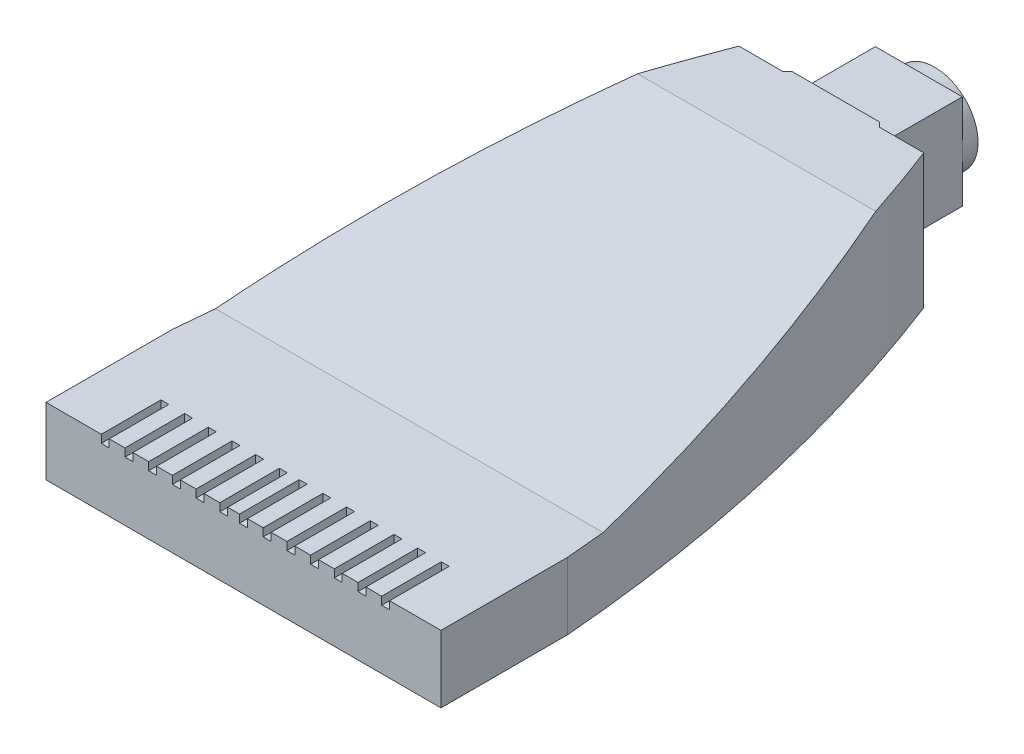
ISO-10303-21;
HEADER;
FILE_DESCRIPTION(('STEP AP214'),'2;1');
FILE_NAME('part.step','',(''),(''),'','','');
FILE_SCHEMA(('AUTOMOTIVE_DESIGN { 1 0 10303 214 1 1 1 1 }'));
ENDSEC;
DATA;
#1=APPLICATION_CONTEXT('core data for automotive mechanical design processes');
#2=APPLICATION_PROTOCOL_DEFINITION('international standard','automotive_design',2000,#1);
#3=PRODUCT_CONTEXT('',#1,'mechanical');
#4=PRODUCT('Part','Part','',(#3));
#5=PRODUCT_RELATED_PRODUCT_CATEGORY('part','',(#4));
#6=PRODUCT_DEFINITION_FORMATION('','',#4);
#7=PRODUCT_DEFINITION_CONTEXT('part definition',#1,'design');
#8=PRODUCT_DEFINITION('design','',#6,#7);
#9=PRODUCT_DEFINITION_SHAPE('','',#8);
#10=(LENGTH_UNIT() NAMED_UNIT(*) SI_UNIT(.MILLI.,.METRE.));
#11=(NAMED_UNIT(*) PLANE_ANGLE_UNIT() SI_UNIT($,.RADIAN.));
#12=(NAMED_UNIT(*) SI_UNIT($,.STERADIAN.) SOLID_ANGLE_UNIT());
#13=UNCERTAINTY_MEASURE_WITH_UNIT(LENGTH_MEASURE(1.E-05),#10,'distance_accuracy_value','');
#14=(GEOMETRIC_REPRESENTATION_CONTEXT(3) GLOBAL_UNCERTAINTY_ASSIGNED_CONTEXT((#13)) GLOBAL_UNIT_ASSIGNED_CONTEXT((#10,
#11,#12)) REPRESENTATION_CONTEXT('',''));
#15=CARTESIAN_POINT('',(0.,0.,0.));
#16=DIRECTION('',(0.,0.,1.));
#17=DIRECTION('',(1.,0.,0.));
#18=AXIS2_PLACEMENT_3D('',#15,#16,#17);
#19=CARTESIAN_POINT('',(0.,17.,23.9406843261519));
#20=DIRECTION('',(0.,0.,-1.));
#21=DIRECTION('',(-1.,0.,0.));
#22=AXIS2_PLACEMENT_3D('',#19,#20,#21);
#23=PLANE('',#22);
#24=DIRECTION('',(0.,1.,0.));
#25=VECTOR('',#24,1.);
#26=CARTESIAN_POINT('',(17.,7.5,23.9406843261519));
#27=LINE('',#26,#25);
#28=CARTESIAN_POINT('',(17.,7.5,23.9406843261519));
#29=VERTEX_POINT('',#28);
#30=CARTESIAN_POINT('',(17.,8.5,23.9406843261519));
#31=VERTEX_POINT('',#30);
#32=EDGE_CURVE('E508',#29,#31,#27,.T.);
#33=ORIENTED_EDGE('',*,*,#32,.T.);
#34=DIRECTION('',(1.,0.,0.));
#35=VECTOR('',#34,1.);
#36=CARTESIAN_POINT('',(-55.5,8.5,23.940684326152));
#37=LINE('',#36,#35);
#38=CARTESIAN_POINT('',(15.,8.5,23.9406843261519));
#39=VERTEX_POINT('',#38);
#40=EDGE_CURVE('E971',#39,#31,#37,.T.);
#41=ORIENTED_EDGE('',*,*,#40,.F.);
#42=DIRECTION('',(0.,1.,0.));
#43=VECTOR('',#42,1.);
#44=CARTESIAN_POINT('',(15.,7.5,23.9406843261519));
#45=LINE('',#44,#43);
#46=CARTESIAN_POINT('',(15.,7.5,23.9406843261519));
#47=VERTEX_POINT('',#46);
#48=EDGE_CURVE('E60',#47,#39,#45,.T.);
#49=ORIENTED_EDGE('',*,*,#48,.F.);
#50=DIRECTION('',(1.,0.,0.));
#51=VECTOR('',#50,1.);
#52=CARTESIAN_POINT('',(0.,7.5,23.940684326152));
#53=LINE('',#52,#51);
#54=CARTESIAN_POINT('',(14.,7.5,23.9406843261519));
#55=VERTEX_POINT('',#54);
#56=EDGE_CURVE('E494',#55,#47,#53,.T.);
#57=ORIENTED_EDGE('',*,*,#56,.F.);
#58=DIRECTION('',(0.,1.,0.));
#59=VECTOR('',#58,1.);
#60=CARTESIAN_POINT('',(14.,7.5,23.9406843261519));
#61=LINE('',#60,#59);
#62=CARTESIAN_POINT('',(14.,8.5,23.9406843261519));
#63=VERTEX_POINT('',#62);
#64=EDGE_CURVE('E513',#55,#63,#61,.T.);
#65=ORIENTED_EDGE('',*,*,#64,.T.);
#66=CARTESIAN_POINT('',(12.,8.5,23.940684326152));
#67=VERTEX_POINT('',#66);
#68=EDGE_CURVE('E1861',#67,#63,#37,.T.);
#69=ORIENTED_EDGE('',*,*,#68,.F.);
#70=DIRECTION('',(0.,1.,0.));
#71=VECTOR('',#70,1.);
#72=CARTESIAN_POINT('',(12.,7.5,23.940684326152));
#73=LINE('',#72,#71);
#74=CARTESIAN_POINT('',(12.,7.5,23.940684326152));
#75=VERTEX_POINT('',#74);
#76=EDGE_CURVE('E533',#75,#67,#73,.T.);
#77=ORIENTED_EDGE('',*,*,#76,.F.);
#78=DIRECTION('',(1.,0.,0.));
#79=VECTOR('',#78,1.);
#80=CARTESIAN_POINT('',(0.,7.5,23.940684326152));
#81=LINE('',#80,#79);
#82=CARTESIAN_POINT('',(11.,7.5,23.940684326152));
#83=VERTEX_POINT('',#82);
#84=EDGE_CURVE('E522',#83,#75,#81,.T.);
#85=ORIENTED_EDGE('',*,*,#84,.F.);
#86=DIRECTION('',(0.,1.,0.));
#87=VECTOR('',#86,1.);
#88=CARTESIAN_POINT('',(11.,7.5,23.940684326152));
#89=LINE('',#88,#87);
#90=CARTESIAN_POINT('',(11.,8.5,23.940684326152));
#91=VERTEX_POINT('',#90);
#92=EDGE_CURVE('E541',#83,#91,#89,.T.);
#93=ORIENTED_EDGE('',*,*,#92,.T.);
#94=CARTESIAN_POINT('',(8.99999999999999,8.5,23.940684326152));
#95=VERTEX_POINT('',#94);
#96=EDGE_CURVE('E1863',#95,#91,#37,.T.);
#97=ORIENTED_EDGE('',*,*,#96,.F.);
#98=DIRECTION('',(0.,1.,0.));
#99=VECTOR('',#98,1.);
#100=CARTESIAN_POINT('',(9.,7.5,23.940684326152));
#101=LINE('',#100,#99);
#102=CARTESIAN_POINT('',(9.,7.5,23.940684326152));
#103=VERTEX_POINT('',#102);
#104=EDGE_CURVE('E561',#103,#95,#101,.T.);
#105=ORIENTED_EDGE('',*,*,#104,.F.);
#106=DIRECTION('',(1.,0.,0.));
#107=VECTOR('',#106,1.);
#108=CARTESIAN_POINT('',(0.,7.5,23.940684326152));
#109=LINE('',#108,#107);
#110=CARTESIAN_POINT('',(8.,7.5,23.940684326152));
#111=VERTEX_POINT('',#110);
#112=EDGE_CURVE('E550',#111,#103,#109,.T.);
#113=ORIENTED_EDGE('',*,*,#112,.F.);
#114=DIRECTION('',(0.,1.,0.));
#115=VECTOR('',#114,1.);
#116=CARTESIAN_POINT('',(8.,7.5,23.940684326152));
#117=LINE('',#116,#115);
#118=CARTESIAN_POINT('',(8.,8.5,23.940684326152));
#119=VERTEX_POINT('',#118);
#120=EDGE_CURVE('E569',#111,#119,#117,.T.);
#121=ORIENTED_EDGE('',*,*,#120,.T.);
#122=CARTESIAN_POINT('',(6.,8.5,23.940684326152));
#123=VERTEX_POINT('',#122);
#124=EDGE_CURVE('E1867',#123,#119,#37,.T.);
#125=ORIENTED_EDGE('',*,*,#124,.F.);
#126=DIRECTION('',(0.,1.,0.));
#127=VECTOR('',#126,1.);
#128=CARTESIAN_POINT('',(6.,7.5,23.940684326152));
#129=LINE('',#128,#127);
#130=CARTESIAN_POINT('',(6.,7.5,23.940684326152));
#131=VERTEX_POINT('',#130);
#132=EDGE_CURVE('E589',#131,#123,#129,.T.);
#133=ORIENTED_EDGE('',*,*,#132,.F.);
#134=DIRECTION('',(1.,0.,0.));
#135=VECTOR('',#134,1.);
#136=CARTESIAN_POINT('',(0.,7.5,23.940684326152));
#137=LINE('',#136,#135);
#138=CARTESIAN_POINT('',(5.,7.5,23.940684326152));
#139=VERTEX_POINT('',#138);
#140=EDGE_CURVE('E578',#139,#131,#137,.T.);
#141=ORIENTED_EDGE('',*,*,#140,.F.);
#142=DIRECTION('',(0.,1.,0.));
#143=VECTOR('',#142,1.);
#144=CARTESIAN_POINT('',(5.,7.5,23.940684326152));
#145=LINE('',#144,#143);
#146=CARTESIAN_POINT('',(5.,8.5,23.940684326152));
#147=VERTEX_POINT('',#146);
#148=EDGE_CURVE('E597',#139,#147,#145,.T.);
#149=ORIENTED_EDGE('',*,*,#148,.T.);
#150=CARTESIAN_POINT('',(3.,8.5,23.940684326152));
#151=VERTEX_POINT('',#150);
#152=EDGE_CURVE('E1871',#151,#147,#37,.T.);
#153=ORIENTED_EDGE('',*,*,#152,.F.);
#154=DIRECTION('',(0.,1.,0.));
#155=VECTOR('',#154,1.);
#156=CARTESIAN_POINT('',(3.,7.5,23.940684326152));
#157=LINE('',#156,#155);
#158=CARTESIAN_POINT('',(3.,7.5,23.940684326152));
#159=VERTEX_POINT('',#158);
#160=EDGE_CURVE('E618',#159,#151,#157,.T.);
#161=ORIENTED_EDGE('',*,*,#160,.F.);
#162=DIRECTION('',(1.,0.,0.));
#163=VECTOR('',#162,1.);
#164=CARTESIAN_POINT('',(0.,7.5,23.940684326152));
#165=LINE('',#164,#163);
#166=CARTESIAN_POINT('',(2.,7.5,23.940684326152));
#167=VERTEX_POINT('',#166);
#168=EDGE_CURVE('E606',#167,#159,#165,.T.);
#169=ORIENTED_EDGE('',*,*,#168,.F.);
#170=DIRECTION('',(0.,1.,0.));
#171=VECTOR('',#170,1.);
#172=CARTESIAN_POINT('',(2.,7.5,23.940684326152));
#173=LINE('',#172,#171);
#174=CARTESIAN_POINT('',(2.,8.5,23.940684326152));
#175=VERTEX_POINT('',#174);
#176=EDGE_CURVE('E625',#167,#175,#173,.T.);
#177=ORIENTED_EDGE('',*,*,#176,.T.);
#178=CARTESIAN_POINT('',(0.,8.5,23.940684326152));
#179=VERTEX_POINT('',#178);
#180=EDGE_CURVE('E1875',#179,#175,#37,.T.);
#181=ORIENTED_EDGE('',*,*,#180,.F.);
#182=DIRECTION('',(0.,1.,0.));
#183=VECTOR('',#182,1.);
#184=CARTESIAN_POINT('',(0.,7.5,23.940684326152));
#185=LINE('',#184,#183);
#186=CARTESIAN_POINT('',(0.,7.5,23.940684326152));
#187=VERTEX_POINT('',#186);
#188=EDGE_CURVE('E645',#187,#179,#185,.T.);
#189=ORIENTED_EDGE('',*,*,#188,.F.);
#190=DIRECTION('',(1.,0.,0.));
#191=VECTOR('',#190,1.);
#192=CARTESIAN_POINT('',(0.,7.5,23.940684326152));
#193=LINE('',#192,#191);
#194=CARTESIAN_POINT('',(-1.,7.5,23.940684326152));
#195=VERTEX_POINT('',#194);
#196=EDGE_CURVE('E634',#195,#187,#193,.T.);
#197=ORIENTED_EDGE('',*,*,#196,.F.);
#198=DIRECTION('',(0.,1.,0.));
#199=VECTOR('',#198,1.);
#200=CARTESIAN_POINT('',(-1.,7.5,23.940684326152));
#201=LINE('',#200,#199);
#202=CARTESIAN_POINT('',(-1.,8.5,23.940684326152));
#203=VERTEX_POINT('',#202);
#204=EDGE_CURVE('E653',#195,#203,#201,.T.);
#205=ORIENTED_EDGE('',*,*,#204,.T.);
#206=CARTESIAN_POINT('',(-2.5,8.5,23.940684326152));
#207=VERTEX_POINT('',#206);
#208=EDGE_CURVE('E1879',#207,#203,#37,.T.);
#209=ORIENTED_EDGE('',*,*,#208,.F.);
#210=DIRECTION('',(0.,1.,0.));
#211=VECTOR('',#210,1.);
#212=CARTESIAN_POINT('',(-2.5,7.5,23.940684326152));
#213=LINE('',#212,#211);
#214=CARTESIAN_POINT('',(-2.5,7.5,23.940684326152));
#215=VERTEX_POINT('',#214);
#216=EDGE_CURVE('E680',#215,#207,#213,.T.);
#217=ORIENTED_EDGE('',*,*,#216,.F.);
#218=DIRECTION('',(1.,0.,0.));
#219=VECTOR('',#218,1.);
#220=CARTESIAN_POINT('',(0.,7.5,23.940684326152));
#221=LINE('',#220,#219);
#222=CARTESIAN_POINT('',(-3.5,7.5,23.940684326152));
#223=VERTEX_POINT('',#222);
#224=EDGE_CURVE('E669',#223,#215,#221,.T.);
#225=ORIENTED_EDGE('',*,*,#224,.F.);
#226=DIRECTION('',(0.,1.,0.));
#227=VECTOR('',#226,1.);
#228=CARTESIAN_POINT('',(-3.5,7.5,23.940684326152));
#229=LINE('',#228,#227);
#230=CARTESIAN_POINT('',(-3.5,8.5,23.940684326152));
#231=VERTEX_POINT('',#230);
#232=EDGE_CURVE('E683',#223,#231,#229,.T.);
#233=ORIENTED_EDGE('',*,*,#232,.T.);
#234=CARTESIAN_POINT('',(-5.5,8.5,23.940684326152));
#235=VERTEX_POINT('',#234);
#236=EDGE_CURVE('E1884',#235,#231,#37,.T.);
#237=ORIENTED_EDGE('',*,*,#236,.F.);
#238=DIRECTION('',(0.,1.,0.));
#239=VECTOR('',#238,1.);
#240=CARTESIAN_POINT('',(-5.5,7.5,23.940684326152));
#241=LINE('',#240,#239);
#242=CARTESIAN_POINT('',(-5.5,7.5,23.940684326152));
#243=VERTEX_POINT('',#242);
#244=EDGE_CURVE('E701',#243,#235,#241,.T.);
#245=ORIENTED_EDGE('',*,*,#244,.F.);
#246=DIRECTION('',(1.,0.,0.));
#247=VECTOR('',#246,1.);
#248=CARTESIAN_POINT('',(0.,7.5,23.940684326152));
#249=LINE('',#248,#247);
#250=CARTESIAN_POINT('',(-6.5,7.5,23.940684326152));
#251=VERTEX_POINT('',#250);
#252=EDGE_CURVE('E690',#251,#243,#249,.T.);
#253=ORIENTED_EDGE('',*,*,#252,.F.);
#254=DIRECTION('',(0.,1.,0.));
#255=VECTOR('',#254,1.);
#256=CARTESIAN_POINT('',(-6.5,7.5,23.940684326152));
#257=LINE('',#256,#255);
#258=CARTESIAN_POINT('',(-6.5,8.5,23.940684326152));
#259=VERTEX_POINT('',#258);
#260=EDGE_CURVE('E709',#251,#259,#257,.T.);
#261=ORIENTED_EDGE('',*,*,#260,.T.);
#262=CARTESIAN_POINT('',(-8.49999999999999,8.5,23.940684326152));
#263=VERTEX_POINT('',#262);
#264=EDGE_CURVE('E1887',#263,#259,#37,.T.);
#265=ORIENTED_EDGE('',*,*,#264,.F.);
#266=DIRECTION('',(0.,1.,0.));
#267=VECTOR('',#266,1.);
#268=CARTESIAN_POINT('',(-8.5,7.5,23.940684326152));
#269=LINE('',#268,#267);
#270=CARTESIAN_POINT('',(-8.5,7.5,23.940684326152));
#271=VERTEX_POINT('',#270);
#272=EDGE_CURVE('E729',#271,#263,#269,.T.);
#273=ORIENTED_EDGE('',*,*,#272,.F.);
#274=DIRECTION('',(1.,0.,0.));
#275=VECTOR('',#274,1.);
#276=CARTESIAN_POINT('',(0.,7.5,23.940684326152));
#277=LINE('',#276,#275);
#278=CARTESIAN_POINT('',(-9.5,7.5,23.940684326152));
#279=VERTEX_POINT('',#278);
#280=EDGE_CURVE('E718',#279,#271,#277,.T.);
#281=ORIENTED_EDGE('',*,*,#280,.F.);
#282=DIRECTION('',(0.,1.,0.));
#283=VECTOR('',#282,1.);
#284=CARTESIAN_POINT('',(-9.5,7.5,23.940684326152));
#285=LINE('',#284,#283);
#286=CARTESIAN_POINT('',(-9.5,8.5,23.940684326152));
#287=VERTEX_POINT('',#286);
#288=EDGE_CURVE('E737',#279,#287,#285,.T.);
#289=ORIENTED_EDGE('',*,*,#288,.T.);
#290=CARTESIAN_POINT('',(-11.5,8.5,23.940684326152));
#291=VERTEX_POINT('',#290);
#292=EDGE_CURVE('E1891',#291,#287,#37,.T.);
#293=ORIENTED_EDGE('',*,*,#292,.F.);
#294=DIRECTION('',(0.,1.,0.));
#295=VECTOR('',#294,1.);
#296=CARTESIAN_POINT('',(-11.5,7.5,23.940684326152));
#297=LINE('',#296,#295);
#298=CARTESIAN_POINT('',(-11.5,7.5,23.940684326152));
#299=VERTEX_POINT('',#298);
#300=EDGE_CURVE('E757',#299,#291,#297,.T.);
#301=ORIENTED_EDGE('',*,*,#300,.F.);
#302=DIRECTION('',(1.,0.,0.));
#303=VECTOR('',#302,1.);
#304=CARTESIAN_POINT('',(0.,7.5,23.940684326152));
#305=LINE('',#304,#303);
#306=CARTESIAN_POINT('',(-12.5,7.5,23.940684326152));
#307=VERTEX_POINT('',#306);
#308=EDGE_CURVE('E746',#307,#299,#305,.T.);
#309=ORIENTED_EDGE('',*,*,#308,.F.);
#310=DIRECTION('',(0.,1.,0.));
#311=VECTOR('',#310,1.);
#312=CARTESIAN_POINT('',(-12.5,7.5,23.940684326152));
#313=LINE('',#312,#311);
#314=CARTESIAN_POINT('',(-12.5,8.5,23.940684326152));
#315=VERTEX_POINT('',#314);
#316=EDGE_CURVE('E765',#307,#315,#313,.T.);
#317=ORIENTED_EDGE('',*,*,#316,.T.);
#318=CARTESIAN_POINT('',(-14.5,8.5,23.940684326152));
#319=VERTEX_POINT('',#318);
#320=EDGE_CURVE('E1895',#319,#315,#37,.T.);
#321=ORIENTED_EDGE('',*,*,#320,.F.);
#322=DIRECTION('',(0.,1.,0.));
#323=VECTOR('',#322,1.);
#324=CARTESIAN_POINT('',(-14.5,7.5,23.940684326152));
#325=LINE('',#324,#323);
#326=CARTESIAN_POINT('',(-14.5,7.5,23.940684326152));
#327=VERTEX_POINT('',#326);
#328=EDGE_CURVE('E785',#327,#319,#325,.T.);
#329=ORIENTED_EDGE('',*,*,#328,.F.);
#330=DIRECTION('',(1.,0.,0.));
#331=VECTOR('',#330,1.);
#332=CARTESIAN_POINT('',(0.,7.5,23.940684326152));
#333=LINE('',#332,#331);
#334=CARTESIAN_POINT('',(-15.5,7.5,23.940684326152));
#335=VERTEX_POINT('',#334);
#336=EDGE_CURVE('E774',#335,#327,#333,.T.);
#337=ORIENTED_EDGE('',*,*,#336,.F.);
#338=DIRECTION('',(0.,1.,0.));
#339=VECTOR('',#338,1.);
#340=CARTESIAN_POINT('',(-15.5,7.5,23.940684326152));
#341=LINE('',#340,#339);
#342=CARTESIAN_POINT('',(-15.5,8.5,23.940684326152));
#343=VERTEX_POINT('',#342);
#344=EDGE_CURVE('E793',#335,#343,#341,.T.);
#345=ORIENTED_EDGE('',*,*,#344,.T.);
#346=CARTESIAN_POINT('',(-17.5,8.5,23.940684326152));
#347=VERTEX_POINT('',#346);
#348=EDGE_CURVE('E1090',#347,#343,#37,.T.);
#349=ORIENTED_EDGE('',*,*,#348,.F.);
#350=DIRECTION('',(0.,1.,0.));
#351=VECTOR('',#350,1.);
#352=CARTESIAN_POINT('',(-17.5,7.5,23.940684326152));
#353=LINE('',#352,#351);
#354=CARTESIAN_POINT('',(-17.5,7.5,23.940684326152));
#355=VERTEX_POINT('',#354);
#356=EDGE_CURVE('E813',#355,#347,#353,.T.);
#357=ORIENTED_EDGE('',*,*,#356,.F.);
#358=DIRECTION('',(1.,0.,0.));
#359=VECTOR('',#358,1.);
#360=CARTESIAN_POINT('',(0.,7.5,23.940684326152));
#361=LINE('',#360,#359);
#362=CARTESIAN_POINT('',(-18.5,7.5,23.940684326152));
#363=VERTEX_POINT('',#362);
#364=EDGE_CURVE('E802',#363,#355,#361,.T.);
#365=ORIENTED_EDGE('',*,*,#364,.F.);
#366=DIRECTION('',(0.,1.,0.));
#367=VECTOR('',#366,1.);
#368=CARTESIAN_POINT('',(-18.5,7.5,23.940684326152));
#369=LINE('',#368,#367);
#370=CARTESIAN_POINT('',(-18.5,8.5,23.940684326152));
#371=VERTEX_POINT('',#370);
#372=EDGE_CURVE('E821',#363,#371,#369,.T.);
#373=ORIENTED_EDGE('',*,*,#372,.T.);
#374=CARTESIAN_POINT('',(-25.5,8.5,23.940684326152));
#375=VERTEX_POINT('',#374);
#376=EDGE_CURVE('E944',#375,#371,#37,.T.);
#377=ORIENTED_EDGE('',*,*,#376,.F.);
#378=DIRECTION('',(0.,-1.,0.));
#379=VECTOR('',#378,1.);
#380=CARTESIAN_POINT('',(-25.5,17.,23.940684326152));
#381=LINE('',#380,#379);
#382=CARTESIAN_POINT('',(-25.5,0.,23.940684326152));
#383=VERTEX_POINT('',#382);
#384=EDGE_CURVE('E856',#375,#383,#381,.T.);
#385=ORIENTED_EDGE('',*,*,#384,.T.);
#386=DIRECTION('',(1.,0.,0.));
#387=VECTOR('',#386,1.);
#388=CARTESIAN_POINT('',(0.,0.,23.9406843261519));
#389=LINE('',#388,#387);
#390=CARTESIAN_POINT('',(24.5,0.,23.9406843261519));
#391=VERTEX_POINT('',#390);
#392=EDGE_CURVE('E859',#383,#391,#389,.T.);
#393=ORIENTED_EDGE('',*,*,#392,.T.);
#394=DIRECTION('',(0.,-1.,0.));
#395=VECTOR('',#394,1.);
#396=CARTESIAN_POINT('',(24.5,17.,23.9406843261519));
#397=LINE('',#396,#395);
#398=CARTESIAN_POINT('',(24.5,8.5,23.9406843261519));
#399=VERTEX_POINT('',#398);
#400=EDGE_CURVE('E860',#399,#391,#397,.T.);
#401=ORIENTED_EDGE('',*,*,#400,.F.);
#402=CARTESIAN_POINT('',(18.,8.5,23.9406843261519));
#403=VERTEX_POINT('',#402);
#404=EDGE_CURVE('E487',#403,#399,#37,.T.);
#405=ORIENTED_EDGE('',*,*,#404,.F.);
#406=DIRECTION('',(0.,1.,0.));
#407=VECTOR('',#406,1.);
#408=CARTESIAN_POINT('',(18.,7.5,23.9406843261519));
#409=LINE('',#408,#407);
#410=CARTESIAN_POINT('',(18.,7.5,23.9406843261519));
#411=VERTEX_POINT('',#410);
#412=EDGE_CURVE('E52',#411,#403,#409,.T.);
#413=ORIENTED_EDGE('',*,*,#412,.F.);
#414=DIRECTION('',(1.,0.,0.));
#415=VECTOR('',#414,1.);
#416=CARTESIAN_POINT('',(0.,7.5,23.940684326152));
#417=LINE('',#416,#415);
#418=EDGE_CURVE('E475',#29,#411,#417,.T.);
#419=ORIENTED_EDGE('',*,*,#418,.F.);
#420=EDGE_LOOP('',(#33,#41,#49,#57,#65,#69,#77,#85,#93,#97,#105,#113,#121,#125,#133,#141,#149,
#153,#161,#169,#177,#181,#189,#197,#205,#209,#217,#225,#233,#237,#245,#253,#261,#265,#273,#281,
#289,#293,#301,#309,#317,#321,#329,#337,#345,#349,#357,#365,#373,#377,#385,#393,#401,#405,#413,#419));
#421=FACE_BOUND('',#420,.T.);
#422=ADVANCED_FACE('F35',(#421),#23,.F.);
#423=CARTESIAN_POINT('',(-55.5,8.5,0.));
#424=DIRECTION('',(0.,-1.,0.));
#425=DIRECTION('',(0.,0.,-1.));
#426=AXIS2_PLACEMENT_3D('',#423,#424,#425);
#427=PLANE('',#426);
#428=DIRECTION('',(0.,0.,-1.));
#429=VECTOR('',#428,1.);
#430=CARTESIAN_POINT('',(17.,8.5,0.));
#431=LINE('',#430,#429);
#432=CARTESIAN_POINT('',(17.,8.5,16.3904388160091));
#433=VERTEX_POINT('',#432);
#434=EDGE_CURVE('E483',#31,#433,#431,.T.);
#435=ORIENTED_EDGE('',*,*,#434,.T.);
#436=DIRECTION('',(1.,0.,0.));
#437=VECTOR('',#436,1.);
#438=CARTESIAN_POINT('',(0.,8.5,16.3904388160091));
#439=LINE('',#438,#437);
#440=CARTESIAN_POINT('',(18.,8.5,16.3904388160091));
#441=VERTEX_POINT('',#440);
#442=EDGE_CURVE('E969',#433,#441,#439,.T.);
#443=ORIENTED_EDGE('',*,*,#442,.T.);
#444=DIRECTION('',(0.,0.,-1.));
#445=VECTOR('',#444,1.);
#446=CARTESIAN_POINT('',(18.,8.5,0.));
#447=LINE('',#446,#445);
#448=EDGE_CURVE('E974',#403,#441,#447,.T.);
#449=ORIENTED_EDGE('',*,*,#448,.F.);
#450=ORIENTED_EDGE('',*,*,#404,.T.);
#451=DIRECTION('',(0.,0.,-1.));
#452=VECTOR('',#451,1.);
#453=CARTESIAN_POINT('',(24.5,8.5,0.));
#454=LINE('',#453,#452);
#455=CARTESIAN_POINT('',(24.5,8.5,7.94068432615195));
#456=VERTEX_POINT('',#455);
#457=EDGE_CURVE('E984',#399,#456,#454,.T.);
#458=ORIENTED_EDGE('',*,*,#457,.T.);
#459=CARTESIAN_POINT('',(24.5,8.5,7.94068432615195));
#460=CARTESIAN_POINT('',(22.0650337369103,8.5,-22.2267649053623));
#461=CARTESIAN_POINT('',(11.1947023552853,8.5,-50.4823249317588));
#462=B_SPLINE_CURVE_WITH_KNOTS('',2,(#459,#460,#461),.UNSPECIFIED.,.F.,.F.,(3,3),(0.,1.),.UNSPECIFIED.);
#463=CARTESIAN_POINT('',(24.0372044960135,8.5,2.94146595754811));
#464=VERTEX_POINT('',#463);
#465=EDGE_CURVE('E846',#464,#456,#462,.F.);
#466=ORIENTED_EDGE('',*,*,#465,.F.);
#467=DIRECTION('',(1.,0.,0.));
#468=VECTOR('',#467,1.);
#469=CARTESIAN_POINT('',(-55.5,8.5,2.94146595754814));
#470=LINE('',#469,#468);
#471=CARTESIAN_POINT('',(-25.0372044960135,8.5,2.94146595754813));
#472=VERTEX_POINT('',#471);
#473=EDGE_CURVE('E1004',#472,#464,#470,.T.);
#474=ORIENTED_EDGE('',*,*,#473,.F.);
#475=CARTESIAN_POINT('',(-25.5,8.5,7.94068432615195));
#476=CARTESIAN_POINT('',(-23.0650337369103,8.5,-22.2267649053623));
#477=CARTESIAN_POINT('',(-12.1947023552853,8.5,-50.4823249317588));
#478=B_SPLINE_CURVE_WITH_KNOTS('',2,(#475,#476,#477),.UNSPECIFIED.,.F.,.F.,(3,3),(0.,1.),.UNSPECIFIED.);
#479=CARTESIAN_POINT('',(-25.5,8.5,7.94068432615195));
#480=VERTEX_POINT('',#479);
#481=EDGE_CURVE('E1079',#472,#480,#478,.F.);
#482=ORIENTED_EDGE('',*,*,#481,.T.);
#483=DIRECTION('',(0.,0.,1.));
#484=VECTOR('',#483,1.);
#485=CARTESIAN_POINT('',(-25.5,8.5,0.));
#486=LINE('',#485,#484);
#487=EDGE_CURVE('E986',#480,#375,#486,.T.);
#488=ORIENTED_EDGE('',*,*,#487,.T.);
#489=ORIENTED_EDGE('',*,*,#376,.T.);
#490=DIRECTION('',(0.,0.,-1.));
#491=VECTOR('',#490,1.);
#492=CARTESIAN_POINT('',(-18.5,8.5,0.));
#493=LINE('',#492,#491);
#494=CARTESIAN_POINT('',(-18.5,8.5,16.3904388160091));
#495=VERTEX_POINT('',#494);
#496=EDGE_CURVE('E806',#371,#495,#493,.T.);
#497=ORIENTED_EDGE('',*,*,#496,.T.);
#498=DIRECTION('',(1.,0.,0.));
#499=VECTOR('',#498,1.);
#500=CARTESIAN_POINT('',(0.,8.5,16.3904388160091));
#501=LINE('',#500,#499);
#502=CARTESIAN_POINT('',(-17.5,8.5,16.3904388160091));
#503=VERTEX_POINT('',#502);
#504=EDGE_CURVE('E816',#495,#503,#501,.T.);
#505=ORIENTED_EDGE('',*,*,#504,.T.);
#506=DIRECTION('',(0.,0.,-1.));
#507=VECTOR('',#506,1.);
#508=CARTESIAN_POINT('',(-17.5,8.5,0.));
#509=LINE('',#508,#507);
#510=EDGE_CURVE('E796',#347,#503,#509,.T.);
#511=ORIENTED_EDGE('',*,*,#510,.F.);
#512=ORIENTED_EDGE('',*,*,#348,.T.);
#513=DIRECTION('',(0.,0.,-1.));
#514=VECTOR('',#513,1.);
#515=CARTESIAN_POINT('',(-15.5,8.5,0.));
#516=LINE('',#515,#514);
#517=CARTESIAN_POINT('',(-15.5,8.5,16.3904388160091));
#518=VERTEX_POINT('',#517);
#519=EDGE_CURVE('E778',#343,#518,#516,.T.);
#520=ORIENTED_EDGE('',*,*,#519,.T.);
#521=DIRECTION('',(1.,0.,0.));
#522=VECTOR('',#521,1.);
#523=CARTESIAN_POINT('',(0.,8.5,16.3904388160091));
#524=LINE('',#523,#522);
#525=CARTESIAN_POINT('',(-14.5,8.5,16.3904388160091));
#526=VERTEX_POINT('',#525);
#527=EDGE_CURVE('E788',#518,#526,#524,.T.);
#528=ORIENTED_EDGE('',*,*,#527,.T.);
#529=DIRECTION('',(0.,0.,-1.));
#530=VECTOR('',#529,1.);
#531=CARTESIAN_POINT('',(-14.5,8.5,0.));
#532=LINE('',#531,#530);
#533=EDGE_CURVE('E768',#319,#526,#532,.T.);
#534=ORIENTED_EDGE('',*,*,#533,.F.);
#535=ORIENTED_EDGE('',*,*,#320,.T.);
#536=DIRECTION('',(0.,0.,-1.));
#537=VECTOR('',#536,1.);
#538=CARTESIAN_POINT('',(-12.5,8.5,0.));
#539=LINE('',#538,#537);
#540=CARTESIAN_POINT('',(-12.5,8.5,16.3904388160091));
#541=VERTEX_POINT('',#540);
#542=EDGE_CURVE('E750',#315,#541,#539,.T.);
#543=ORIENTED_EDGE('',*,*,#542,.T.);
#544=DIRECTION('',(1.,0.,0.));
#545=VECTOR('',#544,1.);
#546=CARTESIAN_POINT('',(0.,8.5,16.3904388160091));
#547=LINE('',#546,#545);
#548=CARTESIAN_POINT('',(-11.5,8.5,16.3904388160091));
#549=VERTEX_POINT('',#548);
#550=EDGE_CURVE('E760',#541,#549,#547,.T.);
#551=ORIENTED_EDGE('',*,*,#550,.T.);
#552=DIRECTION('',(0.,0.,-1.));
#553=VECTOR('',#552,1.);
#554=CARTESIAN_POINT('',(-11.5,8.5,0.));
#555=LINE('',#554,#553);
#556=EDGE_CURVE('E740',#291,#549,#555,.T.);
#557=ORIENTED_EDGE('',*,*,#556,.F.);
#558=ORIENTED_EDGE('',*,*,#292,.T.);
#559=DIRECTION('',(0.,0.,-1.));
#560=VECTOR('',#559,1.);
#561=CARTESIAN_POINT('',(-9.5,8.5,0.));
#562=LINE('',#561,#560);
#563=CARTESIAN_POINT('',(-9.5,8.5,16.3904388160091));
#564=VERTEX_POINT('',#563);
#565=EDGE_CURVE('E722',#287,#564,#562,.T.);
#566=ORIENTED_EDGE('',*,*,#565,.T.);
#567=DIRECTION('',(1.,0.,0.));
#568=VECTOR('',#567,1.);
#569=CARTESIAN_POINT('',(0.,8.5,16.3904388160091));
#570=LINE('',#569,#568);
#571=CARTESIAN_POINT('',(-8.5,8.5,16.3904388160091));
#572=VERTEX_POINT('',#571);
#573=EDGE_CURVE('E732',#564,#572,#570,.T.);
#574=ORIENTED_EDGE('',*,*,#573,.T.);
#575=DIRECTION('',(0.,0.,-1.));
#576=VECTOR('',#575,1.);
#577=CARTESIAN_POINT('',(-8.5,8.5,0.));
#578=LINE('',#577,#576);
#579=EDGE_CURVE('E712',#263,#572,#578,.T.);
#580=ORIENTED_EDGE('',*,*,#579,.F.);
#581=ORIENTED_EDGE('',*,*,#264,.T.);
#582=DIRECTION('',(0.,0.,-1.));
#583=VECTOR('',#582,1.);
#584=CARTESIAN_POINT('',(-6.5,8.5,0.));
#585=LINE('',#584,#583);
#586=CARTESIAN_POINT('',(-6.5,8.5,16.3904388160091));
#587=VERTEX_POINT('',#586);
#588=EDGE_CURVE('E694',#259,#587,#585,.T.);
#589=ORIENTED_EDGE('',*,*,#588,.T.);
#590=DIRECTION('',(1.,0.,0.));
#591=VECTOR('',#590,1.);
#592=CARTESIAN_POINT('',(0.,8.5,16.3904388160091));
#593=LINE('',#592,#591);
#594=CARTESIAN_POINT('',(-5.5,8.5,16.3904388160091));
#595=VERTEX_POINT('',#594);
#596=EDGE_CURVE('E704',#587,#595,#593,.T.);
#597=ORIENTED_EDGE('',*,*,#596,.T.);
#598=DIRECTION('',(0.,0.,-1.));
#599=VECTOR('',#598,1.);
#600=CARTESIAN_POINT('',(-5.5,8.5,0.));
#601=LINE('',#600,#599);
#602=EDGE_CURVE('E682',#235,#595,#601,.T.);
#603=ORIENTED_EDGE('',*,*,#602,.F.);
#604=ORIENTED_EDGE('',*,*,#236,.T.);
#605=DIRECTION('',(0.,0.,-1.));
#606=VECTOR('',#605,1.);
#607=CARTESIAN_POINT('',(-3.5,8.5,0.));
#608=LINE('',#607,#606);
#609=CARTESIAN_POINT('',(-3.5,8.5,16.3904388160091));
#610=VERTEX_POINT('',#609);
#611=EDGE_CURVE('E665',#231,#610,#608,.T.);
#612=ORIENTED_EDGE('',*,*,#611,.T.);
#613=DIRECTION('',(1.,0.,0.));
#614=VECTOR('',#613,1.);
#615=CARTESIAN_POINT('',(0.,8.5,16.3904388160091));
#616=LINE('',#615,#614);
#617=CARTESIAN_POINT('',(-2.5,8.5,16.3904388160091));
#618=VERTEX_POINT('',#617);
#619=EDGE_CURVE('E675',#610,#618,#616,.T.);
#620=ORIENTED_EDGE('',*,*,#619,.T.);
#621=DIRECTION('',(0.,0.,1.));
#622=VECTOR('',#621,1.);
#623=CARTESIAN_POINT('',(-2.5,8.5,0.));
#624=LINE('',#623,#622);
#625=EDGE_CURVE('E656',#618,#207,#624,.T.);
#626=ORIENTED_EDGE('',*,*,#625,.T.);
#627=ORIENTED_EDGE('',*,*,#208,.T.);
#628=DIRECTION('',(0.,0.,-1.));
#629=VECTOR('',#628,1.);
#630=CARTESIAN_POINT('',(-1.,8.5,0.));
#631=LINE('',#630,#629);
#632=CARTESIAN_POINT('',(-1.,8.5,16.3904388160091));
#633=VERTEX_POINT('',#632);
#634=EDGE_CURVE('E638',#203,#633,#631,.T.);
#635=ORIENTED_EDGE('',*,*,#634,.T.);
#636=DIRECTION('',(1.,0.,0.));
#637=VECTOR('',#636,1.);
#638=CARTESIAN_POINT('',(0.,8.5,16.3904388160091));
#639=LINE('',#638,#637);
#640=CARTESIAN_POINT('',(0.,8.5,16.3904388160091));
#641=VERTEX_POINT('',#640);
#642=EDGE_CURVE('E648',#633,#641,#639,.T.);
#643=ORIENTED_EDGE('',*,*,#642,.T.);
#644=DIRECTION('',(0.,0.,-1.));
#645=VECTOR('',#644,1.);
#646=CARTESIAN_POINT('',(0.,8.5,0.));
#647=LINE('',#646,#645);
#648=EDGE_CURVE('E628',#179,#641,#647,.T.);
#649=ORIENTED_EDGE('',*,*,#648,.F.);
#650=ORIENTED_EDGE('',*,*,#180,.T.);
#651=DIRECTION('',(0.,0.,1.));
#652=VECTOR('',#651,1.);
#653=CARTESIAN_POINT('',(2.,8.5,0.));
#654=LINE('',#653,#652);
#655=CARTESIAN_POINT('',(2.,8.5,16.3904388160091));
#656=VERTEX_POINT('',#655);
#657=EDGE_CURVE('E610',#656,#175,#654,.T.);
#658=ORIENTED_EDGE('',*,*,#657,.F.);
#659=DIRECTION('',(1.,0.,0.));
#660=VECTOR('',#659,1.);
#661=CARTESIAN_POINT('',(0.,8.5,16.3904388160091));
#662=LINE('',#661,#660);
#663=CARTESIAN_POINT('',(3.,8.5,16.3904388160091));
#664=VERTEX_POINT('',#663);
#665=EDGE_CURVE('E621',#656,#664,#662,.T.);
#666=ORIENTED_EDGE('',*,*,#665,.T.);
#667=DIRECTION('',(0.,0.,-1.));
#668=VECTOR('',#667,1.);
#669=CARTESIAN_POINT('',(3.,8.5,0.));
#670=LINE('',#669,#668);
#671=EDGE_CURVE('E600',#151,#664,#670,.T.);
#672=ORIENTED_EDGE('',*,*,#671,.F.);
#673=ORIENTED_EDGE('',*,*,#152,.T.);
#674=DIRECTION('',(0.,0.,-1.));
#675=VECTOR('',#674,1.);
#676=CARTESIAN_POINT('',(5.,8.5,0.));
#677=LINE('',#676,#675);
#678=CARTESIAN_POINT('',(5.,8.5,16.3904388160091));
#679=VERTEX_POINT('',#678);
#680=EDGE_CURVE('E582',#147,#679,#677,.T.);
#681=ORIENTED_EDGE('',*,*,#680,.T.);
#682=DIRECTION('',(1.,0.,0.));
#683=VECTOR('',#682,1.);
#684=CARTESIAN_POINT('',(0.,8.5,16.3904388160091));
#685=LINE('',#684,#683);
#686=CARTESIAN_POINT('',(6.,8.5,16.3904388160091));
#687=VERTEX_POINT('',#686);
#688=EDGE_CURVE('E592',#679,#687,#685,.T.);
#689=ORIENTED_EDGE('',*,*,#688,.T.);
#690=DIRECTION('',(0.,0.,-1.));
#691=VECTOR('',#690,1.);
#692=CARTESIAN_POINT('',(6.,8.5,0.));
#693=LINE('',#692,#691);
#694=EDGE_CURVE('E572',#123,#687,#693,.T.);
#695=ORIENTED_EDGE('',*,*,#694,.F.);
#696=ORIENTED_EDGE('',*,*,#124,.T.);
#697=DIRECTION('',(0.,0.,-1.));
#698=VECTOR('',#697,1.);
#699=CARTESIAN_POINT('',(8.,8.5,0.));
#700=LINE('',#699,#698);
#701=CARTESIAN_POINT('',(8.,8.5,16.3904388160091));
#702=VERTEX_POINT('',#701);
#703=EDGE_CURVE('E554',#119,#702,#700,.T.);
#704=ORIENTED_EDGE('',*,*,#703,.T.);
#705=DIRECTION('',(1.,0.,0.));
#706=VECTOR('',#705,1.);
#707=CARTESIAN_POINT('',(0.,8.5,16.3904388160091));
#708=LINE('',#707,#706);
#709=CARTESIAN_POINT('',(9.,8.5,16.3904388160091));
#710=VERTEX_POINT('',#709);
#711=EDGE_CURVE('E564',#702,#710,#708,.T.);
#712=ORIENTED_EDGE('',*,*,#711,.T.);
#713=DIRECTION('',(0.,0.,-1.));
#714=VECTOR('',#713,1.);
#715=CARTESIAN_POINT('',(9.,8.5,0.));
#716=LINE('',#715,#714);
#717=EDGE_CURVE('E544',#95,#710,#716,.T.);
#718=ORIENTED_EDGE('',*,*,#717,.F.);
#719=ORIENTED_EDGE('',*,*,#96,.T.);
#720=DIRECTION('',(0.,0.,-1.));
#721=VECTOR('',#720,1.);
#722=CARTESIAN_POINT('',(11.,8.5,0.));
#723=LINE('',#722,#721);
#724=CARTESIAN_POINT('',(11.,8.5,16.3904388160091));
#725=VERTEX_POINT('',#724);
#726=EDGE_CURVE('E526',#91,#725,#723,.T.);
#727=ORIENTED_EDGE('',*,*,#726,.T.);
#728=DIRECTION('',(1.,0.,0.));
#729=VECTOR('',#728,1.);
#730=CARTESIAN_POINT('',(0.,8.5,16.3904388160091));
#731=LINE('',#730,#729);
#732=CARTESIAN_POINT('',(12.,8.5,16.3904388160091));
#733=VERTEX_POINT('',#732);
#734=EDGE_CURVE('E536',#725,#733,#731,.T.);
#735=ORIENTED_EDGE('',*,*,#734,.T.);
#736=DIRECTION('',(0.,0.,-1.));
#737=VECTOR('',#736,1.);
#738=CARTESIAN_POINT('',(12.,8.5,0.));
#739=LINE('',#738,#737);
#740=EDGE_CURVE('E516',#67,#733,#739,.T.);
#741=ORIENTED_EDGE('',*,*,#740,.F.);
#742=ORIENTED_EDGE('',*,*,#68,.T.);
#743=DIRECTION('',(0.,0.,-1.));
#744=VECTOR('',#743,1.);
#745=CARTESIAN_POINT('',(14.,8.5,0.));
#746=LINE('',#745,#744);
#747=CARTESIAN_POINT('',(14.,8.5,16.3904388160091));
#748=VERTEX_POINT('',#747);
#749=EDGE_CURVE('E498',#63,#748,#746,.T.);
#750=ORIENTED_EDGE('',*,*,#749,.T.);
#751=DIRECTION('',(1.,0.,0.));
#752=VECTOR('',#751,1.);
#753=CARTESIAN_POINT('',(0.,8.5,16.3904388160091));
#754=LINE('',#753,#752);
#755=CARTESIAN_POINT('',(15.,8.5,16.3904388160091));
#756=VERTEX_POINT('',#755);
#757=EDGE_CURVE('E507',#748,#756,#754,.T.);
#758=ORIENTED_EDGE('',*,*,#757,.T.);
#759=DIRECTION('',(0.,0.,-1.));
#760=VECTOR('',#759,1.);
#761=CARTESIAN_POINT('',(15.,8.5,0.));
#762=LINE('',#761,#760);
#763=EDGE_CURVE('E505',#39,#756,#762,.T.);
#764=ORIENTED_EDGE('',*,*,#763,.F.);
#765=ORIENTED_EDGE('',*,*,#40,.T.);
#766=EDGE_LOOP('',(#435,#443,#449,#450,#458,#466,#474,#482,#488,#489,#497,#505,#511,#512,#520,
#528,#534,#535,#543,#551,#557,#558,#566,#574,#580,#581,#589,#597,#603,#604,#612,#620,#626,#627,
#635,#643,#649,#650,#658,#666,#672,#673,#681,#689,#695,#696,#704,#712,#718,#719,#727,#735,#741,
#742,#750,#758,#764,#765));
#767=FACE_BOUND('',#766,.T.);
#768=ADVANCED_FACE('F953',(#767),#427,.F.);
#769=CARTESIAN_POINT('',(0.,17.,-50.4823249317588));
#770=DIRECTION('',(0.,0.,-1.));
#771=DIRECTION('',(-1.,0.,0.));
#772=AXIS2_PLACEMENT_3D('',#769,#770,#771);
#773=PLANE('',#772);
#774=DIRECTION('',(0.,-1.,0.));
#775=VECTOR('',#774,1.);
#776=CARTESIAN_POINT('',(5.57699074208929,17.,-50.4823249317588));
#777=LINE('',#776,#775);
#778=CARTESIAN_POINT('',(5.57699074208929,17.,-50.4823249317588));
#779=VERTEX_POINT('',#778);
#780=CARTESIAN_POINT('',(5.57699074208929,0.,-50.4823249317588));
#781=VERTEX_POINT('',#780);
#782=EDGE_CURVE('E867',#779,#781,#777,.T.);
#783=ORIENTED_EDGE('',*,*,#782,.F.);
#784=DIRECTION('',(-1.,0.,0.));
#785=VECTOR('',#784,1.);
#786=CARTESIAN_POINT('',(0.,17.,-50.4823249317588));
#787=LINE('',#786,#785);
#788=CARTESIAN_POINT('',(11.1947023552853,17.,-50.4823249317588));
#789=VERTEX_POINT('',#788);
#790=EDGE_CURVE('E1014',#789,#779,#787,.T.);
#791=ORIENTED_EDGE('',*,*,#790,.F.);
#792=DIRECTION('',(0.,-1.,0.));
#793=VECTOR('',#792,1.);
#794=CARTESIAN_POINT('',(11.1947023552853,17.,-50.4823249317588));
#795=LINE('',#794,#793);
#796=CARTESIAN_POINT('',(11.1947023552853,0.,-50.4823249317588));
#797=VERTEX_POINT('',#796);
#798=EDGE_CURVE('E824',#789,#797,#795,.T.);
#799=ORIENTED_EDGE('',*,*,#798,.T.);
#800=DIRECTION('',(1.,0.,0.));
#801=VECTOR('',#800,1.);
#802=CARTESIAN_POINT('',(0.,0.,-50.4823249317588));
#803=LINE('',#802,#801);
#804=EDGE_CURVE('E885',#781,#797,#803,.T.);
#805=ORIENTED_EDGE('',*,*,#804,.F.);
#806=EDGE_LOOP('',(#783,#791,#799,#805));
#807=FACE_BOUND('',#806,.T.);
#808=ADVANCED_FACE('F956',(#807),#773,.T.);
#809=CARTESIAN_POINT('',(28.029657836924,17.,-28.0296578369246));
#810=DIRECTION('',(0.70710678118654,0.,-0.707106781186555));
#811=DIRECTION('',(-0.707106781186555,0.,-0.70710678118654));
#812=AXIS2_PLACEMENT_3D('',#809,#810,#811);
#813=PLANE('',#812);
#814=DIRECTION('',(0.,-1.,0.));
#815=VECTOR('',#814,1.);
#816=CARTESIAN_POINT('',(5.,17.,-51.059315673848));
#817=LINE('',#816,#815);
#818=CARTESIAN_POINT('',(5.,17.,-51.059315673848));
#819=VERTEX_POINT('',#818);
#820=CARTESIAN_POINT('',(5.,14.5,-51.059315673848));
#821=VERTEX_POINT('',#820);
#822=EDGE_CURVE('E872',#819,#821,#817,.T.);
#823=ORIENTED_EDGE('',*,*,#822,.F.);
#824=DIRECTION('',(-0.707106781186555,0.,-0.70710678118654));
#825=VECTOR('',#824,1.);
#826=CARTESIAN_POINT('',(28.029657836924,17.,-28.0296578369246));
#827=LINE('',#826,#825);
#828=EDGE_CURVE('E1012',#779,#819,#827,.T.);
#829=ORIENTED_EDGE('',*,*,#828,.F.);
#830=ORIENTED_EDGE('',*,*,#782,.T.);
#831=DIRECTION('',(0.707106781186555,0.,0.70710678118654));
#832=VECTOR('',#831,1.);
#833=CARTESIAN_POINT('',(28.029657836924,0.,-28.0296578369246));
#834=LINE('',#833,#832);
#835=CARTESIAN_POINT('',(5.,0.,-51.059315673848));
#836=VERTEX_POINT('',#835);
#837=EDGE_CURVE('E901',#836,#781,#834,.T.);
#838=ORIENTED_EDGE('',*,*,#837,.F.);
#839=DIRECTION('',(0.,-1.,0.));
#840=VECTOR('',#839,1.);
#841=CARTESIAN_POINT('',(5.,0.,-51.059315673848));
#842=LINE('',#841,#840);
#843=CARTESIAN_POINT('',(5.,2.5,-51.059315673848));
#844=VERTEX_POINT('',#843);
#845=EDGE_CURVE('E1107',#844,#836,#842,.T.);
#846=ORIENTED_EDGE('',*,*,#845,.F.);
#847=EDGE_CURVE('E1046',#821,#844,#817,.T.);
#848=ORIENTED_EDGE('',*,*,#847,.F.);
#849=EDGE_LOOP('',(#823,#829,#830,#838,#846,#848));
#850=FACE_BOUND('',#849,.T.);
#851=ADVANCED_FACE('F962',(#850),#813,.T.);
#852=CARTESIAN_POINT('',(-28.5296578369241,17.,-28.5296578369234));
#853=DIRECTION('',(0.707106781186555,0.,0.70710678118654));
#854=DIRECTION('',(0.70710678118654,0.,-0.707106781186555));
#855=AXIS2_PLACEMENT_3D('',#852,#853,#854);
#856=PLANE('',#855);
#857=DIRECTION('',(-0.70710678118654,0.,0.707106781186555));
#858=VECTOR('',#857,1.);
#859=CARTESIAN_POINT('',(-28.5296578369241,17.,-28.5296578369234));
#860=LINE('',#859,#858);
#861=CARTESIAN_POINT('',(-5.99999999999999,17.,-51.059315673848));
#862=VERTEX_POINT('',#861);
#863=CARTESIAN_POINT('',(-6.57699074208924,17.,-50.4823249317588));
#864=VERTEX_POINT('',#863);
#865=EDGE_CURVE('E833',#862,#864,#860,.T.);
#866=ORIENTED_EDGE('',*,*,#865,.F.);
#867=DIRECTION('',(0.,-1.,0.));
#868=VECTOR('',#867,1.);
#869=CARTESIAN_POINT('',(-5.99999999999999,17.,-51.059315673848));
#870=LINE('',#869,#868);
#871=CARTESIAN_POINT('',(-5.99999999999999,14.5,-51.059315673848));
#872=VERTEX_POINT('',#871);
#873=EDGE_CURVE('E1033',#862,#872,#870,.T.);
#874=ORIENTED_EDGE('',*,*,#873,.T.);
#875=CARTESIAN_POINT('',(-5.99999999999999,2.5,-51.059315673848));
#876=VERTEX_POINT('',#875);
#877=EDGE_CURVE('E1038',#872,#876,#870,.T.);
#878=ORIENTED_EDGE('',*,*,#877,.T.);
#879=DIRECTION('',(0.,-1.,0.));
#880=VECTOR('',#879,1.);
#881=CARTESIAN_POINT('',(-5.99999999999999,0.,-51.059315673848));
#882=LINE('',#881,#880);
#883=CARTESIAN_POINT('',(-5.99999999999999,0.,-51.059315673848));
#884=VERTEX_POINT('',#883);
#885=EDGE_CURVE('E900',#876,#884,#882,.T.);
#886=ORIENTED_EDGE('',*,*,#885,.T.);
#887=DIRECTION('',(-0.70710678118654,0.,0.707106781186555));
#888=VECTOR('',#887,1.);
#889=CARTESIAN_POINT('',(-28.5296578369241,0.,-28.5296578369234));
#890=LINE('',#889,#888);
#891=CARTESIAN_POINT('',(-6.57699074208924,0.,-50.4823249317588));
#892=VERTEX_POINT('',#891);
#893=EDGE_CURVE('E897',#884,#892,#890,.T.);
#894=ORIENTED_EDGE('',*,*,#893,.T.);
#895=DIRECTION('',(0.,-1.,0.));
#896=VECTOR('',#895,1.);
#897=CARTESIAN_POINT('',(-6.57699074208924,17.,-50.4823249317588));
#898=LINE('',#897,#896);
#899=EDGE_CURVE('E845',#864,#892,#898,.T.);
#900=ORIENTED_EDGE('',*,*,#899,.F.);
#901=EDGE_LOOP('',(#866,#874,#878,#886,#894,#900));
#902=FACE_BOUND('',#901,.T.);
#903=ADVANCED_FACE('F1031',(#902),#856,.F.);
#904=CARTESIAN_POINT('',(0.,17.,-50.4823249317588));
#905=DIRECTION('',(0.,0.,-1.));
#906=DIRECTION('',(-1.,0.,0.));
#907=AXIS2_PLACEMENT_3D('',#904,#905,#906);
#908=PLANE('',#907);
#909=DIRECTION('',(0.,-1.,0.));
#910=VECTOR('',#909,1.);
#911=CARTESIAN_POINT('',(-12.1947023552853,17.,-50.4823249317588));
#912=LINE('',#911,#910);
#913=CARTESIAN_POINT('',(-12.1947023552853,17.,-50.4823249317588));
#914=VERTEX_POINT('',#913);
#915=CARTESIAN_POINT('',(-12.1947023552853,0.,-50.4823249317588));
#916=VERTEX_POINT('',#915);
#917=EDGE_CURVE('E841',#914,#916,#912,.T.);
#918=ORIENTED_EDGE('',*,*,#917,.F.);
#919=DIRECTION('',(-1.,0.,0.));
#920=VECTOR('',#919,1.);
#921=CARTESIAN_POINT('',(0.,17.,-50.4823249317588));
#922=LINE('',#921,#920);
#923=EDGE_CURVE('E44',#864,#914,#922,.T.);
#924=ORIENTED_EDGE('',*,*,#923,.F.);
#925=ORIENTED_EDGE('',*,*,#899,.T.);
#926=DIRECTION('',(1.,0.,0.));
#927=VECTOR('',#926,1.);
#928=CARTESIAN_POINT('',(0.,0.,-50.4823249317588));
#929=LINE('',#928,#927);
#930=EDGE_CURVE('E890',#916,#892,#929,.T.);
#931=ORIENTED_EDGE('',*,*,#930,.F.);
#932=EDGE_LOOP('',(#918,#924,#925,#931));
#933=FACE_BOUND('',#932,.T.);
#934=ADVANCED_FACE('F1098',(#933),#908,.T.);
#935=CARTESIAN_POINT('',(-25.5,17.,7.94068432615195));
#936=CARTESIAN_POINT('',(-23.0650337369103,17.,-22.2267649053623));
#937=CARTESIAN_POINT('',(-12.1947023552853,17.,-50.4823249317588));
#938=B_SPLINE_CURVE_WITH_KNOTS('',2,(#935,#936,#937),.UNSPECIFIED.,.F.,.F.,(3,3),(0.,1.),.UNSPECIFIED.);
#939=DIRECTION('',(0.,-1.,0.));
#940=VECTOR('',#939,1.);
#941=SURFACE_OF_LINEAR_EXTRUSION('',#938,#940);
#942=CARTESIAN_POINT('',(-15.5783973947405,17.0000000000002,-41.0270976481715));
#943=CARTESIAN_POINT('',(-16.1669456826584,16.6566007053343,-39.2507713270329));
#944=CARTESIAN_POINT('',(-16.7316785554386,16.3117296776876,-37.4668320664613));
#945=CARTESIAN_POINT('',(-17.8129404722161,15.6192746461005,-33.884919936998));
#946=CARTESIAN_POINT('',(-18.3294693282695,15.2716906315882,-32.0869470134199));
#947=CARTESIAN_POINT('',(-19.3123640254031,14.5750220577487,-28.4832391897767));
#948=CARTESIAN_POINT('',(-19.7788666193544,14.2259444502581,-26.677540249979));
#949=CARTESIAN_POINT('',(-20.6629592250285,13.5255659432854,-23.0546417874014));
#950=CARTESIAN_POINT('',(-21.0805493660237,13.1742650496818,-21.2374422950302));
#951=CARTESIAN_POINT('',(-21.871018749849,12.465673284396,-17.5720585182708));
#952=CARTESIAN_POINT('',(-22.2433345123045,12.1083597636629,-15.7237570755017));
#953=CARTESIAN_POINT('',(-22.9375165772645,11.3919698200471,-12.0180350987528));
#954=CARTESIAN_POINT('',(-23.2593825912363,11.0328933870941,-10.1606145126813));
#955=CARTESIAN_POINT('',(-23.8535066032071,10.3122178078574,-6.43272391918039));
#956=CARTESIAN_POINT('',(-24.125620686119,9.95061438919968,-4.5622318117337));
#957=CARTESIAN_POINT('',(-24.6192870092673,9.22617008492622,-0.814846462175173));
#958=CARTESIAN_POINT('',(-24.8408398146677,8.8633292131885,1.06204670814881));
#959=CARTESIAN_POINT('',(-25.0372044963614,8.5,2.94146595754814));
#960=B_SPLINE_CURVE_WITH_KNOTS('',3,(#942,#943,#944,#945,#946,#947,#948,#949,#950,#951,#952,
#953,#954,#955,#956,#957,#958,#959),.UNSPECIFIED.,.F.,.F.,(4,2,2,2,2,2,2,2,4),(0.,
5.70745607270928,11.4149343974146,17.1063900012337,22.797830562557,28.5541017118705,
34.3104057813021,40.0831061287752,45.8557419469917),.UNSPECIFIED.);
#961=CARTESIAN_POINT('',(-15.5783973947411,17.,-41.0270976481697));
#962=VERTEX_POINT('',#961);
#963=EDGE_CURVE('E938',#962,#472,#960,.T.);
#964=ORIENTED_EDGE('',*,*,#963,.F.);
#965=CARTESIAN_POINT('',(-12.1947023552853,17.,-50.4823249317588));
#966=CARTESIAN_POINT('',(-23.0650337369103,17.,-22.2267649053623));
#967=CARTESIAN_POINT('',(-25.5,17.,7.94068432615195));
#968=B_SPLINE_CURVE_WITH_KNOTS('',2,(#965,#966,#967),.UNSPECIFIED.,.F.,.F.,(3,3),(0.,1.),.UNSPECIFIED.);
#969=EDGE_CURVE('E11',#914,#962,#968,.T.);
#970=ORIENTED_EDGE('',*,*,#969,.F.);
#971=ORIENTED_EDGE('',*,*,#917,.T.);
#972=CARTESIAN_POINT('',(-25.5,0.,7.94068432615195));
#973=CARTESIAN_POINT('',(-23.0650337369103,0.,-22.2267649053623));
#974=CARTESIAN_POINT('',(-12.1947023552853,0.,-50.4823249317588));
#975=B_SPLINE_CURVE_WITH_KNOTS('',2,(#972,#973,#974),.UNSPECIFIED.,.F.,.F.,(3,3),(0.,1.),.UNSPECIFIED.);
#976=CARTESIAN_POINT('',(-25.5,0.,7.94068432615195));
#977=VERTEX_POINT('',#976);
#978=EDGE_CURVE('E884',#977,#916,#975,.T.);
#979=ORIENTED_EDGE('',*,*,#978,.F.);
#980=DIRECTION('',(0.,-1.,0.));
#981=VECTOR('',#980,1.);
#982=CARTESIAN_POINT('',(-25.5,17.,7.94068432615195));
#983=LINE('',#982,#981);
#984=EDGE_CURVE('E854',#480,#977,#983,.T.);
#985=ORIENTED_EDGE('',*,*,#984,.F.);
#986=ORIENTED_EDGE('',*,*,#481,.F.);
#987=EDGE_LOOP('',(#964,#970,#971,#979,#985,#986));
#988=FACE_BOUND('',#987,.T.);
#989=ADVANCED_FACE('F924',(#988),#941,.T.);
#990=CARTESIAN_POINT('',(24.5,17.,7.94068432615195));
#991=CARTESIAN_POINT('',(22.0650337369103,17.,-22.2267649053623));
#992=CARTESIAN_POINT('',(11.1947023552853,17.,-50.4823249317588));
#993=B_SPLINE_CURVE_WITH_KNOTS('',2,(#990,#991,#992),.UNSPECIFIED.,.F.,.F.,(3,3),(0.,1.),.UNSPECIFIED.);
#994=DIRECTION('',(0.,-1.,0.));
#995=VECTOR('',#994,1.);
#996=SURFACE_OF_LINEAR_EXTRUSION('',#993,#995);
#997=CARTESIAN_POINT('',(24.5,17.,7.94068432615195));
#998=CARTESIAN_POINT('',(22.0650337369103,17.,-22.2267649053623));
#999=CARTESIAN_POINT('',(11.1947023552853,17.,-50.4823249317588));
#1000=B_SPLINE_CURVE_WITH_KNOTS('',2,(#997,#998,#999),.UNSPECIFIED.,.F.,.F.,(3,3),(0.,1.),.UNSPECIFIED.);
#1001=CARTESIAN_POINT('',(14.5783973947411,17.,-41.0270976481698));
#1002=VERTEX_POINT('',#1001);
#1003=EDGE_CURVE('E1009',#1002,#789,#1000,.T.);
#1004=ORIENTED_EDGE('',*,*,#1003,.F.);
#1005=CARTESIAN_POINT('',(14.5783973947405,17.0000000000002,-41.0270976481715));
#1006=CARTESIAN_POINT('',(15.1669456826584,16.6566007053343,-39.2507713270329));
#1007=CARTESIAN_POINT('',(15.7316785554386,16.3117296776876,-37.4668320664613));
#1008=CARTESIAN_POINT('',(16.8129404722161,15.6192746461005,-33.884919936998));
#1009=CARTESIAN_POINT('',(17.3294693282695,15.2716906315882,-32.0869470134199));
#1010=CARTESIAN_POINT('',(18.3123640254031,14.5750220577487,-28.4832391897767));
#1011=CARTESIAN_POINT('',(18.7788666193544,14.2259444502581,-26.677540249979));
#1012=CARTESIAN_POINT('',(19.6629592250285,13.5255659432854,-23.0546417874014));
#1013=CARTESIAN_POINT('',(20.0805493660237,13.1742650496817,-21.2374422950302));
#1014=CARTESIAN_POINT('',(20.871018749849,12.465673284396,-17.5720585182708));
#1015=CARTESIAN_POINT('',(21.2433345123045,12.1083597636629,-15.7237570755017));
#1016=CARTESIAN_POINT('',(21.9375165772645,11.3919698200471,-12.0180350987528));
#1017=CARTESIAN_POINT('',(22.2593825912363,11.0328933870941,-10.1606145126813));
#1018=CARTESIAN_POINT('',(22.8535066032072,10.3122178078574,-6.43272391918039));
#1019=CARTESIAN_POINT('',(23.125620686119,9.95061438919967,-4.56223181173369));
#1020=CARTESIAN_POINT('',(23.6192870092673,9.22617008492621,-0.814846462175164));
#1021=CARTESIAN_POINT('',(23.8408398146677,8.8633292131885,1.06204670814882));
#1022=CARTESIAN_POINT('',(24.0372044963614,8.49999999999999,2.94146595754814));
#1023=B_SPLINE_CURVE_WITH_KNOTS('',3,(#1005,#1006,#1007,#1008,#1009,#1010,#1011,#1012,#1013,
#1014,#1015,#1016,#1017,#1018,#1019,#1020,#1021,#1022),.UNSPECIFIED.,.F.,.F.,(4,2,2,2,2,2,2,2,
4),(0.,5.70745607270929,11.4149343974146,17.1063900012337,22.797830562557,28.5541017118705,
34.3104057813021,40.0831061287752,45.8557419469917),.UNSPECIFIED.);
#1024=EDGE_CURVE('E844',#1002,#464,#1023,.T.);
#1025=ORIENTED_EDGE('',*,*,#1024,.T.);
#1026=ORIENTED_EDGE('',*,*,#465,.T.);
#1027=DIRECTION('',(0.,-1.,0.));
#1028=VECTOR('',#1027,1.);
#1029=CARTESIAN_POINT('',(24.5,17.,7.94068432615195));
#1030=LINE('',#1029,#1028);
#1031=CARTESIAN_POINT('',(24.5,0.,7.94068432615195));
#1032=VERTEX_POINT('',#1031);
#1033=EDGE_CURVE('E863',#456,#1032,#1030,.T.);
#1034=ORIENTED_EDGE('',*,*,#1033,.T.);
#1035=CARTESIAN_POINT('',(24.5,0.,7.94068432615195));
#1036=CARTESIAN_POINT('',(22.0650337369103,0.,-22.2267649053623));
#1037=CARTESIAN_POINT('',(11.1947023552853,0.,-50.4823249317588));
#1038=B_SPLINE_CURVE_WITH_KNOTS('',2,(#1035,#1036,#1037),.UNSPECIFIED.,.F.,.F.,(3,3),(0.,1.),.UNSPECIFIED.);
#1039=EDGE_CURVE('E865',#1032,#797,#1038,.T.);
#1040=ORIENTED_EDGE('',*,*,#1039,.T.);
#1041=ORIENTED_EDGE('',*,*,#798,.F.);
#1042=EDGE_LOOP('',(#1004,#1025,#1026,#1034,#1040,#1041));
#1043=FACE_BOUND('',#1042,.T.);
#1044=ADVANCED_FACE('F918',(#1043),#996,.F.);
#1045=CARTESIAN_POINT('',(-5.99999999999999,17.,-51.059315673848));
#1046=DIRECTION('',(0.,0.,1.));
#1047=DIRECTION('',(1.,0.,0.));
#1048=AXIS2_PLACEMENT_3D('',#1045,#1046,#1047);
#1049=PLANE('',#1048);
#1050=DIRECTION('',(-1.,0.,0.));
#1051=VECTOR('',#1050,1.);
#1052=CARTESIAN_POINT('',(0.,17.,-51.059315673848));
#1053=LINE('',#1052,#1051);
#1054=EDGE_CURVE('E39',#819,#862,#1053,.T.);
#1055=ORIENTED_EDGE('',*,*,#1054,.F.);
#1056=ORIENTED_EDGE('',*,*,#822,.T.);
#1057=DIRECTION('',(1.,0.,0.));
#1058=VECTOR('',#1057,1.);
#1059=CARTESIAN_POINT('',(-5.99999999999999,14.5,-51.059315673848));
#1060=LINE('',#1059,#1058);
#1061=EDGE_CURVE('E1036',#872,#821,#1060,.T.);
#1062=ORIENTED_EDGE('',*,*,#1061,.F.);
#1063=ORIENTED_EDGE('',*,*,#873,.F.);
#1064=EDGE_LOOP('',(#1055,#1056,#1062,#1063));
#1065=FACE_BOUND('',#1064,.T.);
#1066=ADVANCED_FACE('F923',(#1065),#1049,.F.);
#1067=CARTESIAN_POINT('',(0.,17.,-61.559315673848));
#1068=DIRECTION('',(0.,0.,-1.));
#1069=DIRECTION('',(-1.,0.,0.));
#1070=AXIS2_PLACEMENT_3D('',#1067,#1068,#1069);
#1071=PLANE('',#1070);
#1072=CARTESIAN_POINT('',(-0.499999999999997,8.49718293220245,-61.559315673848));
#1073=DIRECTION('',(0.,0.,-1.));
#1074=DIRECTION('',(-1.,0.,0.));
#1075=AXIS2_PLACEMENT_3D('',#1072,#1073,#1074);
#1076=CIRCLE('',#1075,5.5);
#1077=CARTESIAN_POINT('',(-6.,8.49718293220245,-61.559315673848));
#1078=VERTEX_POINT('',#1077);
#1079=CARTESIAN_POINT('',(5.,8.49718293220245,-61.559315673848));
#1080=VERTEX_POINT('',#1079);
#1081=EDGE_CURVE('E1071',#1078,#1080,#1076,.T.);
#1082=ORIENTED_EDGE('',*,*,#1081,.F.);
#1083=DIRECTION('',(0.,-1.,0.));
#1084=VECTOR('',#1083,1.);
#1085=CARTESIAN_POINT('',(-5.99999999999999,17.,-61.559315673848));
#1086=LINE('',#1085,#1084);
#1087=CARTESIAN_POINT('',(-6.,14.5,-61.559315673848));
#1088=VERTEX_POINT('',#1087);
#1089=EDGE_CURVE('E1040',#1088,#1078,#1086,.T.);
#1090=ORIENTED_EDGE('',*,*,#1089,.F.);
#1091=DIRECTION('',(1.,0.,0.));
#1092=VECTOR('',#1091,1.);
#1093=CARTESIAN_POINT('',(-6.,14.5,-61.559315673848));
#1094=LINE('',#1093,#1092);
#1095=CARTESIAN_POINT('',(5.,14.5,-61.559315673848));
#1096=VERTEX_POINT('',#1095);
#1097=EDGE_CURVE('E1047',#1088,#1096,#1094,.T.);
#1098=ORIENTED_EDGE('',*,*,#1097,.T.);
#1099=DIRECTION('',(0.,-1.,0.));
#1100=VECTOR('',#1099,1.);
#1101=CARTESIAN_POINT('',(5.,17.,-61.559315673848));
#1102=LINE('',#1101,#1100);
#1103=EDGE_CURVE('E1043',#1096,#1080,#1102,.T.);
#1104=ORIENTED_EDGE('',*,*,#1103,.T.);
#1105=EDGE_LOOP('',(#1082,#1090,#1098,#1104));
#1106=FACE_BOUND('',#1105,.T.);
#1107=ADVANCED_FACE('F1124',(#1106),#1071,.T.);
#1108=CARTESIAN_POINT('',(5.00000000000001,17.,0.));
#1109=DIRECTION('',(1.,0.,0.));
#1110=DIRECTION('',(0.,0.,-1.));
#1111=AXIS2_PLACEMENT_3D('',#1108,#1109,#1110);
#1112=PLANE('',#1111);
#1113=DIRECTION('',(0.,0.,1.));
#1114=VECTOR('',#1113,1.);
#1115=CARTESIAN_POINT('',(5.,2.5,-51.059315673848));
#1116=LINE('',#1115,#1114);
#1117=CARTESIAN_POINT('',(5.,2.5,-61.559315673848));
#1118=VERTEX_POINT('',#1117);
#1119=EDGE_CURVE('E1112',#1118,#844,#1116,.T.);
#1120=ORIENTED_EDGE('',*,*,#1119,.F.);
#1121=EDGE_CURVE('E1048',#1080,#1118,#1102,.T.);
#1122=ORIENTED_EDGE('',*,*,#1121,.F.);
#1123=ORIENTED_EDGE('',*,*,#1103,.F.);
#1124=DIRECTION('',(0.,0.,-1.));
#1125=VECTOR('',#1124,1.);
#1126=CARTESIAN_POINT('',(5.,14.5,-61.559315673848));
#1127=LINE('',#1126,#1125);
#1128=EDGE_CURVE('E896',#821,#1096,#1127,.T.);
#1129=ORIENTED_EDGE('',*,*,#1128,.F.);
#1130=ORIENTED_EDGE('',*,*,#847,.T.);
#1131=EDGE_LOOP('',(#1120,#1122,#1123,#1129,#1130));
#1132=FACE_BOUND('',#1131,.T.);
#1133=ADVANCED_FACE('F1125',(#1132),#1112,.T.);
#1134=EDGE_CURVE('E1074',#1080,#1078,#1076,.T.);
#1135=ORIENTED_EDGE('',*,*,#1134,.F.);
#1136=ORIENTED_EDGE('',*,*,#1121,.T.);
#1137=DIRECTION('',(1.,0.,0.));
#1138=VECTOR('',#1137,1.);
#1139=CARTESIAN_POINT('',(-6.,2.5,-61.559315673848));
#1140=LINE('',#1139,#1138);
#1141=CARTESIAN_POINT('',(-6.,2.5,-61.559315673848));
#1142=VERTEX_POINT('',#1141);
#1143=EDGE_CURVE('E1075',#1142,#1118,#1140,.T.);
#1144=ORIENTED_EDGE('',*,*,#1143,.F.);
#1145=EDGE_CURVE('E857',#1078,#1142,#1086,.T.);
#1146=ORIENTED_EDGE('',*,*,#1145,.F.);
#1147=EDGE_LOOP('',(#1135,#1136,#1144,#1146));
#1148=FACE_BOUND('',#1147,.T.);
#1149=ADVANCED_FACE('F1127',(#1148),#1071,.T.);
#1150=CARTESIAN_POINT('',(-5.99999999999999,17.,0.));
#1151=DIRECTION('',(-1.,0.,0.));
#1152=DIRECTION('',(0.,0.,1.));
#1153=AXIS2_PLACEMENT_3D('',#1150,#1151,#1152);
#1154=PLANE('',#1153);
#1155=DIRECTION('',(0.,0.,1.));
#1156=VECTOR('',#1155,1.);
#1157=CARTESIAN_POINT('',(-5.99999999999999,2.5,-51.059315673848));
#1158=LINE('',#1157,#1156);
#1159=EDGE_CURVE('E1056',#1142,#876,#1158,.T.);
#1160=ORIENTED_EDGE('',*,*,#1159,.T.);
#1161=ORIENTED_EDGE('',*,*,#877,.F.);
#1162=DIRECTION('',(0.,0.,-1.));
#1163=VECTOR('',#1162,1.);
#1164=CARTESIAN_POINT('',(-6.,14.5,-61.559315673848));
#1165=LINE('',#1164,#1163);
#1166=EDGE_CURVE('E1042',#872,#1088,#1165,.T.);
#1167=ORIENTED_EDGE('',*,*,#1166,.T.);
#1168=ORIENTED_EDGE('',*,*,#1089,.T.);
#1169=ORIENTED_EDGE('',*,*,#1145,.T.);
#1170=EDGE_LOOP('',(#1160,#1161,#1167,#1168,#1169));
#1171=FACE_BOUND('',#1170,.T.);
#1172=ADVANCED_FACE('F1133',(#1171),#1154,.T.);
#1173=CARTESIAN_POINT('',(-25.5,17.,0.));
#1174=DIRECTION('',(-1.,0.,0.));
#1175=DIRECTION('',(0.,0.,1.));
#1176=AXIS2_PLACEMENT_3D('',#1173,#1174,#1175);
#1177=PLANE('',#1176);
#1178=ORIENTED_EDGE('',*,*,#487,.F.);
#1179=ORIENTED_EDGE('',*,*,#984,.T.);
#1180=DIRECTION('',(0.,0.,-1.));
#1181=VECTOR('',#1180,1.);
#1182=CARTESIAN_POINT('',(-25.5,0.,0.));
#1183=LINE('',#1182,#1181);
#1184=EDGE_CURVE('E881',#383,#977,#1183,.T.);
#1185=ORIENTED_EDGE('',*,*,#1184,.F.);
#1186=ORIENTED_EDGE('',*,*,#384,.F.);
#1187=EDGE_LOOP('',(#1178,#1179,#1185,#1186));
#1188=FACE_BOUND('',#1187,.T.);
#1189=ADVANCED_FACE('F1091',(#1188),#1177,.T.);
#1190=CARTESIAN_POINT('',(24.5,17.,0.));
#1191=DIRECTION('',(-1.,0.,0.));
#1192=DIRECTION('',(0.,0.,1.));
#1193=AXIS2_PLACEMENT_3D('',#1190,#1191,#1192);
#1194=PLANE('',#1193);
#1195=ORIENTED_EDGE('',*,*,#1033,.F.);
#1196=ORIENTED_EDGE('',*,*,#457,.F.);
#1197=ORIENTED_EDGE('',*,*,#400,.T.);
#1198=DIRECTION('',(0.,0.,-1.));
#1199=VECTOR('',#1198,1.);
#1200=CARTESIAN_POINT('',(24.5,0.,0.));
#1201=LINE('',#1200,#1199);
#1202=EDGE_CURVE('E862',#391,#1032,#1201,.T.);
#1203=ORIENTED_EDGE('',*,*,#1202,.T.);
#1204=EDGE_LOOP('',(#1195,#1196,#1197,#1203));
#1205=FACE_BOUND('',#1204,.T.);
#1206=ADVANCED_FACE('F926',(#1205),#1194,.F.);
#1207=CARTESIAN_POINT('',(0.,0.,0.));
#1208=DIRECTION('',(0.,1.,0.));
#1209=DIRECTION('',(0.,0.,1.));
#1210=AXIS2_PLACEMENT_3D('',#1207,#1208,#1209);
#1211=PLANE('',#1210);
#1212=ORIENTED_EDGE('',*,*,#893,.F.);
#1213=DIRECTION('',(1.,0.,0.));
#1214=VECTOR('',#1213,1.);
#1215=CARTESIAN_POINT('',(-5.99999999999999,0.,-51.059315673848));
#1216=LINE('',#1215,#1214);
#1217=EDGE_CURVE('E878',#884,#836,#1216,.T.);
#1218=ORIENTED_EDGE('',*,*,#1217,.T.);
#1219=ORIENTED_EDGE('',*,*,#837,.T.);
#1220=ORIENTED_EDGE('',*,*,#804,.T.);
#1221=ORIENTED_EDGE('',*,*,#1039,.F.);
#1222=ORIENTED_EDGE('',*,*,#1202,.F.);
#1223=ORIENTED_EDGE('',*,*,#392,.F.);
#1224=ORIENTED_EDGE('',*,*,#1184,.T.);
#1225=ORIENTED_EDGE('',*,*,#978,.T.);
#1226=ORIENTED_EDGE('',*,*,#930,.T.);
#1227=EDGE_LOOP('',(#1212,#1218,#1219,#1220,#1221,#1222,#1223,#1224,#1225,#1226));
#1228=FACE_BOUND('',#1227,.T.);
#1229=ADVANCED_FACE('F928',(#1228),#1211,.F.);
#1230=CARTESIAN_POINT('',(-6.,14.5,-61.559315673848));
#1231=DIRECTION('',(0.,-1.,0.));
#1232=DIRECTION('',(0.,0.,-1.));
#1233=AXIS2_PLACEMENT_3D('',#1230,#1231,#1232);
#1234=PLANE('',#1233);
#1235=ORIENTED_EDGE('',*,*,#1128,.T.);
#1236=ORIENTED_EDGE('',*,*,#1097,.F.);
#1237=ORIENTED_EDGE('',*,*,#1166,.F.);
#1238=ORIENTED_EDGE('',*,*,#1061,.T.);
#1239=EDGE_LOOP('',(#1235,#1236,#1237,#1238));
#1240=FACE_BOUND('',#1239,.T.);
#1241=ADVANCED_FACE('F1119',(#1240),#1234,.F.);
#1242=CARTESIAN_POINT('',(-5.99999999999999,0.,-51.059315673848));
#1243=DIRECTION('',(0.,0.,1.));
#1244=DIRECTION('',(1.,0.,0.));
#1245=AXIS2_PLACEMENT_3D('',#1242,#1243,#1244);
#1246=PLANE('',#1245);
#1247=ORIENTED_EDGE('',*,*,#845,.T.);
#1248=ORIENTED_EDGE('',*,*,#1217,.F.);
#1249=ORIENTED_EDGE('',*,*,#885,.F.);
#1250=DIRECTION('',(1.,0.,0.));
#1251=VECTOR('',#1250,1.);
#1252=CARTESIAN_POINT('',(-5.99999999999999,2.5,-51.059315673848));
#1253=LINE('',#1252,#1251);
#1254=EDGE_CURVE('E1110',#876,#844,#1253,.T.);
#1255=ORIENTED_EDGE('',*,*,#1254,.T.);
#1256=EDGE_LOOP('',(#1247,#1248,#1249,#1255));
#1257=FACE_BOUND('',#1256,.T.);
#1258=ADVANCED_FACE('F1155',(#1257),#1246,.F.);
#1259=CARTESIAN_POINT('',(-5.99999999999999,2.5,-51.059315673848));
#1260=DIRECTION('',(0.,1.,0.));
#1261=DIRECTION('',(0.,0.,1.));
#1262=AXIS2_PLACEMENT_3D('',#1259,#1260,#1261);
#1263=PLANE('',#1262);
#1264=ORIENTED_EDGE('',*,*,#1119,.T.);
#1265=ORIENTED_EDGE('',*,*,#1254,.F.);
#1266=ORIENTED_EDGE('',*,*,#1159,.F.);
#1267=ORIENTED_EDGE('',*,*,#1143,.T.);
#1268=EDGE_LOOP('',(#1264,#1265,#1266,#1267));
#1269=FACE_BOUND('',#1268,.T.);
#1270=ADVANCED_FACE('F1160',(#1269),#1263,.F.);
#1271=CARTESIAN_POINT('',(-0.499999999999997,8.49718293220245,-63.559315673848));
#1272=DIRECTION('',(0.,0.,1.));
#1273=DIRECTION('',(1.,0.,0.));
#1274=AXIS2_PLACEMENT_3D('',#1271,#1272,#1273);
#1275=CYLINDRICAL_SURFACE('',#1274,5.5);
#1276=CARTESIAN_POINT('',(-0.499999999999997,8.49718293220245,-63.559315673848));
#1277=DIRECTION('',(0.,0.,-1.));
#1278=DIRECTION('',(-1.,0.,0.));
#1279=AXIS2_PLACEMENT_3D('',#1276,#1277,#1278);
#1280=CIRCLE('',#1279,5.5);
#1281=CARTESIAN_POINT('',(-6.,8.49718293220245,-63.559315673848));
#1282=VERTEX_POINT('',#1281);
#1283=EDGE_CURVE('E1076',#1282,#1282,#1280,.T.);
#1284=ORIENTED_EDGE('',*,*,#1283,.F.);
#1285=EDGE_LOOP('',(#1284));
#1286=FACE_BOUND('',#1285,.T.);
#1287=ORIENTED_EDGE('',*,*,#1081,.T.);
#1288=ORIENTED_EDGE('',*,*,#1134,.T.);
#1289=EDGE_LOOP('',(#1287,#1288));
#1290=FACE_BOUND('',#1289,.T.);
#1291=ADVANCED_FACE('F1164',(#1286,#1290),#1275,.T.);
#1292=CARTESIAN_POINT('',(-0.499999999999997,8.49718293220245,-63.559315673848));
#1293=DIRECTION('',(0.,0.,-1.));
#1294=DIRECTION('',(-1.,0.,0.));
#1295=AXIS2_PLACEMENT_3D('',#1292,#1293,#1294);
#1296=PLANE('',#1295);
#1297=ORIENTED_EDGE('',*,*,#1283,.T.);
#1298=EDGE_LOOP('',(#1297));
#1299=FACE_BOUND('',#1298,.T.);
#1300=ADVANCED_FACE('F950',(#1299),#1296,.T.);
#1301=CARTESIAN_POINT('',(-55.5,8.74193518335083,1.68999036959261));
#1302=DIRECTION('',(0.,-0.981821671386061,-0.189805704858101));
#1303=DIRECTION('',(0.,0.189805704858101,-0.981821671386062));
#1304=AXIS2_PLACEMENT_3D('',#1301,#1302,#1303);
#1305=PLANE('',#1304);
#1306=ORIENTED_EDGE('',*,*,#963,.T.);
#1307=ORIENTED_EDGE('',*,*,#473,.T.);
#1308=ORIENTED_EDGE('',*,*,#1024,.F.);
#1309=DIRECTION('',(-1.,0.,0.));
#1310=VECTOR('',#1309,1.);
#1311=CARTESIAN_POINT('',(0.,17.,-41.0270976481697));
#1312=LINE('',#1311,#1310);
#1313=EDGE_CURVE('E1008',#1002,#962,#1312,.T.);
#1314=ORIENTED_EDGE('',*,*,#1313,.T.);
#1315=EDGE_LOOP('',(#1306,#1307,#1308,#1314));
#1316=FACE_BOUND('',#1315,.T.);
#1317=ADVANCED_FACE('F946',(#1316),#1305,.F.);
#1318=CARTESIAN_POINT('',(0.,17.,0.));
#1319=DIRECTION('',(0.,1.,0.));
#1320=DIRECTION('',(0.,0.,1.));
#1321=AXIS2_PLACEMENT_3D('',#1318,#1319,#1320);
#1322=PLANE('',#1321);
#1323=ORIENTED_EDGE('',*,*,#1313,.F.);
#1324=ORIENTED_EDGE('',*,*,#1003,.T.);
#1325=ORIENTED_EDGE('',*,*,#790,.T.);
#1326=ORIENTED_EDGE('',*,*,#828,.T.);
#1327=ORIENTED_EDGE('',*,*,#1054,.T.);
#1328=ORIENTED_EDGE('',*,*,#865,.T.);
#1329=ORIENTED_EDGE('',*,*,#923,.T.);
#1330=ORIENTED_EDGE('',*,*,#969,.T.);
#1331=EDGE_LOOP('',(#1323,#1324,#1325,#1326,#1327,#1328,#1329,#1330));
#1332=FACE_BOUND('',#1331,.T.);
#1333=ADVANCED_FACE('F37',(#1332),#1322,.T.);
#1334=CARTESIAN_POINT('',(-18.5,7.5,0.));
#1335=DIRECTION('',(1.,0.,0.));
#1336=DIRECTION('',(0.,0.,-1.));
#1337=AXIS2_PLACEMENT_3D('',#1334,#1335,#1336);
#1338=PLANE('',#1337);
#1339=ORIENTED_EDGE('',*,*,#496,.F.);
#1340=ORIENTED_EDGE('',*,*,#372,.F.);
#1341=DIRECTION('',(0.,0.,-1.));
#1342=VECTOR('',#1341,1.);
#1343=CARTESIAN_POINT('',(-18.5,7.5,0.));
#1344=LINE('',#1343,#1342);
#1345=CARTESIAN_POINT('',(-18.5,7.5,16.3904388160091));
#1346=VERTEX_POINT('',#1345);
#1347=EDGE_CURVE('E811',#363,#1346,#1344,.T.);
#1348=ORIENTED_EDGE('',*,*,#1347,.T.);
#1349=DIRECTION('',(0.,1.,0.));
#1350=VECTOR('',#1349,1.);
#1351=CARTESIAN_POINT('',(-18.5,7.5,16.3904388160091));
#1352=LINE('',#1351,#1350);
#1353=EDGE_CURVE('E825',#1346,#495,#1352,.T.);
#1354=ORIENTED_EDGE('',*,*,#1353,.T.);
#1355=EDGE_LOOP('',(#1339,#1340,#1348,#1354));
#1356=FACE_BOUND('',#1355,.T.);
#1357=ADVANCED_FACE('F1187',(#1356),#1338,.T.);
#1358=CARTESIAN_POINT('',(0.,7.5,16.3904388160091));
#1359=DIRECTION('',(0.,0.,1.));
#1360=DIRECTION('',(1.,0.,0.));
#1361=AXIS2_PLACEMENT_3D('',#1358,#1359,#1360);
#1362=PLANE('',#1361);
#1363=ORIENTED_EDGE('',*,*,#504,.F.);
#1364=ORIENTED_EDGE('',*,*,#1353,.F.);
#1365=DIRECTION('',(1.,0.,0.));
#1366=VECTOR('',#1365,1.);
#1367=CARTESIAN_POINT('',(0.,7.5,16.3904388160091));
#1368=LINE('',#1367,#1366);
#1369=CARTESIAN_POINT('',(-17.5,7.5,16.3904388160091));
#1370=VERTEX_POINT('',#1369);
#1371=EDGE_CURVE('E809',#1346,#1370,#1368,.T.);
#1372=ORIENTED_EDGE('',*,*,#1371,.T.);
#1373=DIRECTION('',(0.,1.,0.));
#1374=VECTOR('',#1373,1.);
#1375=CARTESIAN_POINT('',(-17.5,7.5,16.3904388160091));
#1376=LINE('',#1375,#1374);
#1377=EDGE_CURVE('E827',#1370,#503,#1376,.T.);
#1378=ORIENTED_EDGE('',*,*,#1377,.T.);
#1379=EDGE_LOOP('',(#1363,#1364,#1372,#1378));
#1380=FACE_BOUND('',#1379,.T.);
#1381=ADVANCED_FACE('F1194',(#1380),#1362,.T.);
#1382=CARTESIAN_POINT('',(-17.5,7.5,0.));
#1383=DIRECTION('',(1.,0.,0.));
#1384=DIRECTION('',(0.,0.,-1.));
#1385=AXIS2_PLACEMENT_3D('',#1382,#1383,#1384);
#1386=PLANE('',#1385);
#1387=ORIENTED_EDGE('',*,*,#510,.T.);
#1388=ORIENTED_EDGE('',*,*,#1377,.F.);
#1389=DIRECTION('',(0.,0.,-1.));
#1390=VECTOR('',#1389,1.);
#1391=CARTESIAN_POINT('',(-17.5,7.5,0.));
#1392=LINE('',#1391,#1390);
#1393=EDGE_CURVE('E805',#355,#1370,#1392,.T.);
#1394=ORIENTED_EDGE('',*,*,#1393,.F.);
#1395=ORIENTED_EDGE('',*,*,#356,.T.);
#1396=EDGE_LOOP('',(#1387,#1388,#1394,#1395));
#1397=FACE_BOUND('',#1396,.T.);
#1398=ADVANCED_FACE('F1202',(#1397),#1386,.F.);
#1399=CARTESIAN_POINT('',(0.,7.5,0.));
#1400=DIRECTION('',(0.,1.,0.));
#1401=DIRECTION('',(0.,0.,1.));
#1402=AXIS2_PLACEMENT_3D('',#1399,#1400,#1401);
#1403=PLANE('',#1402);
#1404=ORIENTED_EDGE('',*,*,#364,.T.);
#1405=ORIENTED_EDGE('',*,*,#1393,.T.);
#1406=ORIENTED_EDGE('',*,*,#1371,.F.);
#1407=ORIENTED_EDGE('',*,*,#1347,.F.);
#1408=EDGE_LOOP('',(#1404,#1405,#1406,#1407));
#1409=FACE_BOUND('',#1408,.T.);
#1410=ADVANCED_FACE('F1210',(#1409),#1403,.T.);
#1411=CARTESIAN_POINT('',(-15.5,7.5,0.));
#1412=DIRECTION('',(1.,0.,0.));
#1413=DIRECTION('',(0.,0.,-1.));
#1414=AXIS2_PLACEMENT_3D('',#1411,#1412,#1413);
#1415=PLANE('',#1414);
#1416=ORIENTED_EDGE('',*,*,#519,.F.);
#1417=ORIENTED_EDGE('',*,*,#344,.F.);
#1418=DIRECTION('',(0.,0.,-1.));
#1419=VECTOR('',#1418,1.);
#1420=CARTESIAN_POINT('',(-15.5,7.5,0.));
#1421=LINE('',#1420,#1419);
#1422=CARTESIAN_POINT('',(-15.5,7.5,16.3904388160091));
#1423=VERTEX_POINT('',#1422);
#1424=EDGE_CURVE('E783',#335,#1423,#1421,.T.);
#1425=ORIENTED_EDGE('',*,*,#1424,.T.);
#1426=DIRECTION('',(0.,1.,0.));
#1427=VECTOR('',#1426,1.);
#1428=CARTESIAN_POINT('',(-15.5,7.5,16.3904388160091));
#1429=LINE('',#1428,#1427);
#1430=EDGE_CURVE('E797',#1423,#518,#1429,.T.);
#1431=ORIENTED_EDGE('',*,*,#1430,.T.);
#1432=EDGE_LOOP('',(#1416,#1417,#1425,#1431));
#1433=FACE_BOUND('',#1432,.T.);
#1434=ADVANCED_FACE('F1218',(#1433),#1415,.T.);
#1435=CARTESIAN_POINT('',(0.,7.5,16.3904388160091));
#1436=DIRECTION('',(0.,0.,1.));
#1437=DIRECTION('',(1.,0.,0.));
#1438=AXIS2_PLACEMENT_3D('',#1435,#1436,#1437);
#1439=PLANE('',#1438);
#1440=ORIENTED_EDGE('',*,*,#527,.F.);
#1441=ORIENTED_EDGE('',*,*,#1430,.F.);
#1442=DIRECTION('',(1.,0.,0.));
#1443=VECTOR('',#1442,1.);
#1444=CARTESIAN_POINT('',(0.,7.5,16.3904388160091));
#1445=LINE('',#1444,#1443);
#1446=CARTESIAN_POINT('',(-14.5,7.5,16.3904388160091));
#1447=VERTEX_POINT('',#1446);
#1448=EDGE_CURVE('E781',#1423,#1447,#1445,.T.);
#1449=ORIENTED_EDGE('',*,*,#1448,.T.);
#1450=DIRECTION('',(0.,1.,0.));
#1451=VECTOR('',#1450,1.);
#1452=CARTESIAN_POINT('',(-14.5,7.5,16.3904388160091));
#1453=LINE('',#1452,#1451);
#1454=EDGE_CURVE('E799',#1447,#526,#1453,.T.);
#1455=ORIENTED_EDGE('',*,*,#1454,.T.);
#1456=EDGE_LOOP('',(#1440,#1441,#1449,#1455));
#1457=FACE_BOUND('',#1456,.T.);
#1458=ADVANCED_FACE('F1226',(#1457),#1439,.T.);
#1459=CARTESIAN_POINT('',(-14.5,7.5,0.));
#1460=DIRECTION('',(1.,0.,0.));
#1461=DIRECTION('',(0.,0.,-1.));
#1462=AXIS2_PLACEMENT_3D('',#1459,#1460,#1461);
#1463=PLANE('',#1462);
#1464=ORIENTED_EDGE('',*,*,#533,.T.);
#1465=ORIENTED_EDGE('',*,*,#1454,.F.);
#1466=DIRECTION('',(0.,0.,-1.));
#1467=VECTOR('',#1466,1.);
#1468=CARTESIAN_POINT('',(-14.5,7.5,0.));
#1469=LINE('',#1468,#1467);
#1470=EDGE_CURVE('E777',#327,#1447,#1469,.T.);
#1471=ORIENTED_EDGE('',*,*,#1470,.F.);
#1472=ORIENTED_EDGE('',*,*,#328,.T.);
#1473=EDGE_LOOP('',(#1464,#1465,#1471,#1472));
#1474=FACE_BOUND('',#1473,.T.);
#1475=ADVANCED_FACE('F1234',(#1474),#1463,.F.);
#1476=CARTESIAN_POINT('',(0.,7.5,0.));
#1477=DIRECTION('',(0.,1.,0.));
#1478=DIRECTION('',(0.,0.,1.));
#1479=AXIS2_PLACEMENT_3D('',#1476,#1477,#1478);
#1480=PLANE('',#1479);
#1481=ORIENTED_EDGE('',*,*,#336,.T.);
#1482=ORIENTED_EDGE('',*,*,#1470,.T.);
#1483=ORIENTED_EDGE('',*,*,#1448,.F.);
#1484=ORIENTED_EDGE('',*,*,#1424,.F.);
#1485=EDGE_LOOP('',(#1481,#1482,#1483,#1484));
#1486=FACE_BOUND('',#1485,.T.);
#1487=ADVANCED_FACE('F1242',(#1486),#1480,.T.);
#1488=CARTESIAN_POINT('',(-12.5,7.5,0.));
#1489=DIRECTION('',(1.,0.,0.));
#1490=DIRECTION('',(0.,0.,-1.));
#1491=AXIS2_PLACEMENT_3D('',#1488,#1489,#1490);
#1492=PLANE('',#1491);
#1493=ORIENTED_EDGE('',*,*,#542,.F.);
#1494=ORIENTED_EDGE('',*,*,#316,.F.);
#1495=DIRECTION('',(0.,0.,-1.));
#1496=VECTOR('',#1495,1.);
#1497=CARTESIAN_POINT('',(-12.5,7.5,0.));
#1498=LINE('',#1497,#1496);
#1499=CARTESIAN_POINT('',(-12.5,7.5,16.3904388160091));
#1500=VERTEX_POINT('',#1499);
#1501=EDGE_CURVE('E755',#307,#1500,#1498,.T.);
#1502=ORIENTED_EDGE('',*,*,#1501,.T.);
#1503=DIRECTION('',(0.,1.,0.));
#1504=VECTOR('',#1503,1.);
#1505=CARTESIAN_POINT('',(-12.5,7.5,16.3904388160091));
#1506=LINE('',#1505,#1504);
#1507=EDGE_CURVE('E769',#1500,#541,#1506,.T.);
#1508=ORIENTED_EDGE('',*,*,#1507,.T.);
#1509=EDGE_LOOP('',(#1493,#1494,#1502,#1508));
#1510=FACE_BOUND('',#1509,.T.);
#1511=ADVANCED_FACE('F1250',(#1510),#1492,.T.);
#1512=CARTESIAN_POINT('',(0.,7.5,16.3904388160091));
#1513=DIRECTION('',(0.,0.,1.));
#1514=DIRECTION('',(1.,0.,0.));
#1515=AXIS2_PLACEMENT_3D('',#1512,#1513,#1514);
#1516=PLANE('',#1515);
#1517=ORIENTED_EDGE('',*,*,#550,.F.);
#1518=ORIENTED_EDGE('',*,*,#1507,.F.);
#1519=DIRECTION('',(1.,0.,0.));
#1520=VECTOR('',#1519,1.);
#1521=CARTESIAN_POINT('',(0.,7.5,16.3904388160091));
#1522=LINE('',#1521,#1520);
#1523=CARTESIAN_POINT('',(-11.5,7.5,16.3904388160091));
#1524=VERTEX_POINT('',#1523);
#1525=EDGE_CURVE('E753',#1500,#1524,#1522,.T.);
#1526=ORIENTED_EDGE('',*,*,#1525,.T.);
#1527=DIRECTION('',(0.,1.,0.));
#1528=VECTOR('',#1527,1.);
#1529=CARTESIAN_POINT('',(-11.5,7.5,16.3904388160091));
#1530=LINE('',#1529,#1528);
#1531=EDGE_CURVE('E771',#1524,#549,#1530,.T.);
#1532=ORIENTED_EDGE('',*,*,#1531,.T.);
#1533=EDGE_LOOP('',(#1517,#1518,#1526,#1532));
#1534=FACE_BOUND('',#1533,.T.);
#1535=ADVANCED_FACE('F1258',(#1534),#1516,.T.);
#1536=CARTESIAN_POINT('',(-11.5,7.5,0.));
#1537=DIRECTION('',(1.,0.,0.));
#1538=DIRECTION('',(0.,0.,-1.));
#1539=AXIS2_PLACEMENT_3D('',#1536,#1537,#1538);
#1540=PLANE('',#1539);
#1541=ORIENTED_EDGE('',*,*,#556,.T.);
#1542=ORIENTED_EDGE('',*,*,#1531,.F.);
#1543=DIRECTION('',(0.,0.,-1.));
#1544=VECTOR('',#1543,1.);
#1545=CARTESIAN_POINT('',(-11.5,7.5,0.));
#1546=LINE('',#1545,#1544);
#1547=EDGE_CURVE('E749',#299,#1524,#1546,.T.);
#1548=ORIENTED_EDGE('',*,*,#1547,.F.);
#1549=ORIENTED_EDGE('',*,*,#300,.T.);
#1550=EDGE_LOOP('',(#1541,#1542,#1548,#1549));
#1551=FACE_BOUND('',#1550,.T.);
#1552=ADVANCED_FACE('F1266',(#1551),#1540,.F.);
#1553=CARTESIAN_POINT('',(0.,7.5,0.));
#1554=DIRECTION('',(0.,1.,0.));
#1555=DIRECTION('',(0.,0.,1.));
#1556=AXIS2_PLACEMENT_3D('',#1553,#1554,#1555);
#1557=PLANE('',#1556);
#1558=ORIENTED_EDGE('',*,*,#308,.T.);
#1559=ORIENTED_EDGE('',*,*,#1547,.T.);
#1560=ORIENTED_EDGE('',*,*,#1525,.F.);
#1561=ORIENTED_EDGE('',*,*,#1501,.F.);
#1562=EDGE_LOOP('',(#1558,#1559,#1560,#1561));
#1563=FACE_BOUND('',#1562,.T.);
#1564=ADVANCED_FACE('F1274',(#1563),#1557,.T.);
#1565=CARTESIAN_POINT('',(-9.5,7.5,0.));
#1566=DIRECTION('',(1.,0.,0.));
#1567=DIRECTION('',(0.,0.,-1.));
#1568=AXIS2_PLACEMENT_3D('',#1565,#1566,#1567);
#1569=PLANE('',#1568);
#1570=ORIENTED_EDGE('',*,*,#565,.F.);
#1571=ORIENTED_EDGE('',*,*,#288,.F.);
#1572=DIRECTION('',(0.,0.,-1.));
#1573=VECTOR('',#1572,1.);
#1574=CARTESIAN_POINT('',(-9.5,7.5,0.));
#1575=LINE('',#1574,#1573);
#1576=CARTESIAN_POINT('',(-9.5,7.5,16.3904388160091));
#1577=VERTEX_POINT('',#1576);
#1578=EDGE_CURVE('E727',#279,#1577,#1575,.T.);
#1579=ORIENTED_EDGE('',*,*,#1578,.T.);
#1580=DIRECTION('',(0.,1.,0.));
#1581=VECTOR('',#1580,1.);
#1582=CARTESIAN_POINT('',(-9.5,7.5,16.3904388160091));
#1583=LINE('',#1582,#1581);
#1584=EDGE_CURVE('E741',#1577,#564,#1583,.T.);
#1585=ORIENTED_EDGE('',*,*,#1584,.T.);
#1586=EDGE_LOOP('',(#1570,#1571,#1579,#1585));
#1587=FACE_BOUND('',#1586,.T.);
#1588=ADVANCED_FACE('F1282',(#1587),#1569,.T.);
#1589=CARTESIAN_POINT('',(0.,7.5,16.3904388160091));
#1590=DIRECTION('',(0.,0.,1.));
#1591=DIRECTION('',(1.,0.,0.));
#1592=AXIS2_PLACEMENT_3D('',#1589,#1590,#1591);
#1593=PLANE('',#1592);
#1594=ORIENTED_EDGE('',*,*,#573,.F.);
#1595=ORIENTED_EDGE('',*,*,#1584,.F.);
#1596=DIRECTION('',(1.,0.,0.));
#1597=VECTOR('',#1596,1.);
#1598=CARTESIAN_POINT('',(0.,7.5,16.3904388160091));
#1599=LINE('',#1598,#1597);
#1600=CARTESIAN_POINT('',(-8.5,7.5,16.3904388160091));
#1601=VERTEX_POINT('',#1600);
#1602=EDGE_CURVE('E725',#1577,#1601,#1599,.T.);
#1603=ORIENTED_EDGE('',*,*,#1602,.T.);
#1604=DIRECTION('',(0.,1.,0.));
#1605=VECTOR('',#1604,1.);
#1606=CARTESIAN_POINT('',(-8.5,7.5,16.3904388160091));
#1607=LINE('',#1606,#1605);
#1608=EDGE_CURVE('E743',#1601,#572,#1607,.T.);
#1609=ORIENTED_EDGE('',*,*,#1608,.T.);
#1610=EDGE_LOOP('',(#1594,#1595,#1603,#1609));
#1611=FACE_BOUND('',#1610,.T.);
#1612=ADVANCED_FACE('F1290',(#1611),#1593,.T.);
#1613=CARTESIAN_POINT('',(-8.5,7.5,0.));
#1614=DIRECTION('',(1.,0.,0.));
#1615=DIRECTION('',(0.,0.,-1.));
#1616=AXIS2_PLACEMENT_3D('',#1613,#1614,#1615);
#1617=PLANE('',#1616);
#1618=ORIENTED_EDGE('',*,*,#579,.T.);
#1619=ORIENTED_EDGE('',*,*,#1608,.F.);
#1620=DIRECTION('',(0.,0.,-1.));
#1621=VECTOR('',#1620,1.);
#1622=CARTESIAN_POINT('',(-8.5,7.5,0.));
#1623=LINE('',#1622,#1621);
#1624=EDGE_CURVE('E721',#271,#1601,#1623,.T.);
#1625=ORIENTED_EDGE('',*,*,#1624,.F.);
#1626=ORIENTED_EDGE('',*,*,#272,.T.);
#1627=EDGE_LOOP('',(#1618,#1619,#1625,#1626));
#1628=FACE_BOUND('',#1627,.T.);
#1629=ADVANCED_FACE('F1298',(#1628),#1617,.F.);
#1630=CARTESIAN_POINT('',(0.,7.5,0.));
#1631=DIRECTION('',(0.,1.,0.));
#1632=DIRECTION('',(0.,0.,1.));
#1633=AXIS2_PLACEMENT_3D('',#1630,#1631,#1632);
#1634=PLANE('',#1633);
#1635=ORIENTED_EDGE('',*,*,#280,.T.);
#1636=ORIENTED_EDGE('',*,*,#1624,.T.);
#1637=ORIENTED_EDGE('',*,*,#1602,.F.);
#1638=ORIENTED_EDGE('',*,*,#1578,.F.);
#1639=EDGE_LOOP('',(#1635,#1636,#1637,#1638));
#1640=FACE_BOUND('',#1639,.T.);
#1641=ADVANCED_FACE('F1306',(#1640),#1634,.T.);
#1642=CARTESIAN_POINT('',(-6.5,7.5,0.));
#1643=DIRECTION('',(1.,0.,0.));
#1644=DIRECTION('',(0.,0.,-1.));
#1645=AXIS2_PLACEMENT_3D('',#1642,#1643,#1644);
#1646=PLANE('',#1645);
#1647=ORIENTED_EDGE('',*,*,#588,.F.);
#1648=ORIENTED_EDGE('',*,*,#260,.F.);
#1649=DIRECTION('',(0.,0.,-1.));
#1650=VECTOR('',#1649,1.);
#1651=CARTESIAN_POINT('',(-6.5,7.5,0.));
#1652=LINE('',#1651,#1650);
#1653=CARTESIAN_POINT('',(-6.5,7.5,16.3904388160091));
#1654=VERTEX_POINT('',#1653);
#1655=EDGE_CURVE('E699',#251,#1654,#1652,.T.);
#1656=ORIENTED_EDGE('',*,*,#1655,.T.);
#1657=DIRECTION('',(0.,1.,0.));
#1658=VECTOR('',#1657,1.);
#1659=CARTESIAN_POINT('',(-6.5,7.5,16.3904388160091));
#1660=LINE('',#1659,#1658);
#1661=EDGE_CURVE('E713',#1654,#587,#1660,.T.);
#1662=ORIENTED_EDGE('',*,*,#1661,.T.);
#1663=EDGE_LOOP('',(#1647,#1648,#1656,#1662));
#1664=FACE_BOUND('',#1663,.T.);
#1665=ADVANCED_FACE('F1314',(#1664),#1646,.T.);
#1666=CARTESIAN_POINT('',(0.,7.5,16.3904388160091));
#1667=DIRECTION('',(0.,0.,1.));
#1668=DIRECTION('',(1.,0.,0.));
#1669=AXIS2_PLACEMENT_3D('',#1666,#1667,#1668);
#1670=PLANE('',#1669);
#1671=ORIENTED_EDGE('',*,*,#596,.F.);
#1672=ORIENTED_EDGE('',*,*,#1661,.F.);
#1673=DIRECTION('',(1.,0.,0.));
#1674=VECTOR('',#1673,1.);
#1675=CARTESIAN_POINT('',(0.,7.5,16.3904388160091));
#1676=LINE('',#1675,#1674);
#1677=CARTESIAN_POINT('',(-5.5,7.5,16.3904388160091));
#1678=VERTEX_POINT('',#1677);
#1679=EDGE_CURVE('E697',#1654,#1678,#1676,.T.);
#1680=ORIENTED_EDGE('',*,*,#1679,.T.);
#1681=DIRECTION('',(0.,1.,0.));
#1682=VECTOR('',#1681,1.);
#1683=CARTESIAN_POINT('',(-5.5,7.5,16.3904388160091));
#1684=LINE('',#1683,#1682);
#1685=EDGE_CURVE('E715',#1678,#595,#1684,.T.);
#1686=ORIENTED_EDGE('',*,*,#1685,.T.);
#1687=EDGE_LOOP('',(#1671,#1672,#1680,#1686));
#1688=FACE_BOUND('',#1687,.T.);
#1689=ADVANCED_FACE('F1322',(#1688),#1670,.T.);
#1690=CARTESIAN_POINT('',(-5.5,7.5,0.));
#1691=DIRECTION('',(1.,0.,0.));
#1692=DIRECTION('',(0.,0.,-1.));
#1693=AXIS2_PLACEMENT_3D('',#1690,#1691,#1692);
#1694=PLANE('',#1693);
#1695=ORIENTED_EDGE('',*,*,#602,.T.);
#1696=ORIENTED_EDGE('',*,*,#1685,.F.);
#1697=DIRECTION('',(0.,0.,-1.));
#1698=VECTOR('',#1697,1.);
#1699=CARTESIAN_POINT('',(-5.5,7.5,0.));
#1700=LINE('',#1699,#1698);
#1701=EDGE_CURVE('E693',#243,#1678,#1700,.T.);
#1702=ORIENTED_EDGE('',*,*,#1701,.F.);
#1703=ORIENTED_EDGE('',*,*,#244,.T.);
#1704=EDGE_LOOP('',(#1695,#1696,#1702,#1703));
#1705=FACE_BOUND('',#1704,.T.);
#1706=ADVANCED_FACE('F1330',(#1705),#1694,.F.);
#1707=CARTESIAN_POINT('',(0.,7.5,0.));
#1708=DIRECTION('',(0.,1.,0.));
#1709=DIRECTION('',(0.,0.,1.));
#1710=AXIS2_PLACEMENT_3D('',#1707,#1708,#1709);
#1711=PLANE('',#1710);
#1712=ORIENTED_EDGE('',*,*,#252,.T.);
#1713=ORIENTED_EDGE('',*,*,#1701,.T.);
#1714=ORIENTED_EDGE('',*,*,#1679,.F.);
#1715=ORIENTED_EDGE('',*,*,#1655,.F.);
#1716=EDGE_LOOP('',(#1712,#1713,#1714,#1715));
#1717=FACE_BOUND('',#1716,.T.);
#1718=ADVANCED_FACE('F1338',(#1717),#1711,.T.);
#1719=CARTESIAN_POINT('',(-2.5,7.5,0.));
#1720=DIRECTION('',(-1.,0.,0.));
#1721=DIRECTION('',(0.,0.,1.));
#1722=AXIS2_PLACEMENT_3D('',#1719,#1720,#1721);
#1723=PLANE('',#1722);
#1724=ORIENTED_EDGE('',*,*,#625,.F.);
#1725=DIRECTION('',(0.,1.,0.));
#1726=VECTOR('',#1725,1.);
#1727=CARTESIAN_POINT('',(-2.5,7.5,16.3904388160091));
#1728=LINE('',#1727,#1726);
#1729=CARTESIAN_POINT('',(-2.5,7.5,16.3904388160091));
#1730=VERTEX_POINT('',#1729);
#1731=EDGE_CURVE('E672',#1730,#618,#1728,.T.);
#1732=ORIENTED_EDGE('',*,*,#1731,.F.);
#1733=DIRECTION('',(0.,0.,1.));
#1734=VECTOR('',#1733,1.);
#1735=CARTESIAN_POINT('',(-2.5,7.5,0.));
#1736=LINE('',#1735,#1734);
#1737=EDGE_CURVE('E662',#1730,#215,#1736,.T.);
#1738=ORIENTED_EDGE('',*,*,#1737,.T.);
#1739=ORIENTED_EDGE('',*,*,#216,.T.);
#1740=EDGE_LOOP('',(#1724,#1732,#1738,#1739));
#1741=FACE_BOUND('',#1740,.T.);
#1742=ADVANCED_FACE('F1346',(#1741),#1723,.T.);
#1743=CARTESIAN_POINT('',(-3.5,7.5,0.));
#1744=DIRECTION('',(1.,0.,0.));
#1745=DIRECTION('',(0.,0.,-1.));
#1746=AXIS2_PLACEMENT_3D('',#1743,#1744,#1745);
#1747=PLANE('',#1746);
#1748=ORIENTED_EDGE('',*,*,#611,.F.);
#1749=ORIENTED_EDGE('',*,*,#232,.F.);
#1750=DIRECTION('',(0.,0.,-1.));
#1751=VECTOR('',#1750,1.);
#1752=CARTESIAN_POINT('',(-3.5,7.5,0.));
#1753=LINE('',#1752,#1751);
#1754=CARTESIAN_POINT('',(-3.5,7.5,16.3904388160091));
#1755=VERTEX_POINT('',#1754);
#1756=EDGE_CURVE('E667',#223,#1755,#1753,.T.);
#1757=ORIENTED_EDGE('',*,*,#1756,.T.);
#1758=DIRECTION('',(0.,1.,0.));
#1759=VECTOR('',#1758,1.);
#1760=CARTESIAN_POINT('',(-3.5,7.5,16.3904388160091));
#1761=LINE('',#1760,#1759);
#1762=EDGE_CURVE('E686',#1755,#610,#1761,.T.);
#1763=ORIENTED_EDGE('',*,*,#1762,.T.);
#1764=EDGE_LOOP('',(#1748,#1749,#1757,#1763));
#1765=FACE_BOUND('',#1764,.T.);
#1766=ADVANCED_FACE('F1354',(#1765),#1747,.T.);
#1767=CARTESIAN_POINT('',(0.,7.5,16.3904388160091));
#1768=DIRECTION('',(0.,0.,1.));
#1769=DIRECTION('',(1.,0.,0.));
#1770=AXIS2_PLACEMENT_3D('',#1767,#1768,#1769);
#1771=PLANE('',#1770);
#1772=ORIENTED_EDGE('',*,*,#619,.F.);
#1773=ORIENTED_EDGE('',*,*,#1762,.F.);
#1774=DIRECTION('',(1.,0.,0.));
#1775=VECTOR('',#1774,1.);
#1776=CARTESIAN_POINT('',(0.,7.5,16.3904388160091));
#1777=LINE('',#1776,#1775);
#1778=EDGE_CURVE('E664',#1755,#1730,#1777,.T.);
#1779=ORIENTED_EDGE('',*,*,#1778,.T.);
#1780=ORIENTED_EDGE('',*,*,#1731,.T.);
#1781=EDGE_LOOP('',(#1772,#1773,#1779,#1780));
#1782=FACE_BOUND('',#1781,.T.);
#1783=ADVANCED_FACE('F1362',(#1782),#1771,.T.);
#1784=CARTESIAN_POINT('',(0.,7.5,0.));
#1785=DIRECTION('',(0.,1.,0.));
#1786=DIRECTION('',(0.,0.,1.));
#1787=AXIS2_PLACEMENT_3D('',#1784,#1785,#1786);
#1788=PLANE('',#1787);
#1789=ORIENTED_EDGE('',*,*,#1737,.F.);
#1790=ORIENTED_EDGE('',*,*,#1778,.F.);
#1791=ORIENTED_EDGE('',*,*,#1756,.F.);
#1792=ORIENTED_EDGE('',*,*,#224,.T.);
#1793=EDGE_LOOP('',(#1789,#1790,#1791,#1792));
#1794=FACE_BOUND('',#1793,.T.);
#1795=ADVANCED_FACE('F1370',(#1794),#1788,.T.);
#1796=CARTESIAN_POINT('',(-1.,7.5,0.));
#1797=DIRECTION('',(1.,0.,0.));
#1798=DIRECTION('',(0.,0.,-1.));
#1799=AXIS2_PLACEMENT_3D('',#1796,#1797,#1798);
#1800=PLANE('',#1799);
#1801=ORIENTED_EDGE('',*,*,#634,.F.);
#1802=ORIENTED_EDGE('',*,*,#204,.F.);
#1803=DIRECTION('',(0.,0.,-1.));
#1804=VECTOR('',#1803,1.);
#1805=CARTESIAN_POINT('',(-1.,7.5,0.));
#1806=LINE('',#1805,#1804);
#1807=CARTESIAN_POINT('',(-1.,7.5,16.3904388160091));
#1808=VERTEX_POINT('',#1807);
#1809=EDGE_CURVE('E643',#195,#1808,#1806,.T.);
#1810=ORIENTED_EDGE('',*,*,#1809,.T.);
#1811=DIRECTION('',(0.,1.,0.));
#1812=VECTOR('',#1811,1.);
#1813=CARTESIAN_POINT('',(-1.,7.5,16.3904388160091));
#1814=LINE('',#1813,#1812);
#1815=EDGE_CURVE('E657',#1808,#633,#1814,.T.);
#1816=ORIENTED_EDGE('',*,*,#1815,.T.);
#1817=EDGE_LOOP('',(#1801,#1802,#1810,#1816));
#1818=FACE_BOUND('',#1817,.T.);
#1819=ADVANCED_FACE('F1378',(#1818),#1800,.T.);
#1820=CARTESIAN_POINT('',(0.,7.5,16.3904388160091));
#1821=DIRECTION('',(0.,0.,1.));
#1822=DIRECTION('',(1.,0.,0.));
#1823=AXIS2_PLACEMENT_3D('',#1820,#1821,#1822);
#1824=PLANE('',#1823);
#1825=ORIENTED_EDGE('',*,*,#642,.F.);
#1826=ORIENTED_EDGE('',*,*,#1815,.F.);
#1827=DIRECTION('',(1.,0.,0.));
#1828=VECTOR('',#1827,1.);
#1829=CARTESIAN_POINT('',(0.,7.5,16.3904388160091));
#1830=LINE('',#1829,#1828);
#1831=CARTESIAN_POINT('',(0.,7.5,16.3904388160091));
#1832=VERTEX_POINT('',#1831);
#1833=EDGE_CURVE('E641',#1808,#1832,#1830,.T.);
#1834=ORIENTED_EDGE('',*,*,#1833,.T.);
#1835=DIRECTION('',(0.,1.,0.));
#1836=VECTOR('',#1835,1.);
#1837=CARTESIAN_POINT('',(0.,7.5,16.3904388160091));
#1838=LINE('',#1837,#1836);
#1839=EDGE_CURVE('E659',#1832,#641,#1838,.T.);
#1840=ORIENTED_EDGE('',*,*,#1839,.T.);
#1841=EDGE_LOOP('',(#1825,#1826,#1834,#1840));
#1842=FACE_BOUND('',#1841,.T.);
#1843=ADVANCED_FACE('F1386',(#1842),#1824,.T.);
#1844=CARTESIAN_POINT('',(0.,7.5,0.));
#1845=DIRECTION('',(1.,0.,0.));
#1846=DIRECTION('',(0.,0.,-1.));
#1847=AXIS2_PLACEMENT_3D('',#1844,#1845,#1846);
#1848=PLANE('',#1847);
#1849=ORIENTED_EDGE('',*,*,#648,.T.);
#1850=ORIENTED_EDGE('',*,*,#1839,.F.);
#1851=DIRECTION('',(0.,0.,-1.));
#1852=VECTOR('',#1851,1.);
#1853=CARTESIAN_POINT('',(0.,7.5,0.));
#1854=LINE('',#1853,#1852);
#1855=EDGE_CURVE('E637',#187,#1832,#1854,.T.);
#1856=ORIENTED_EDGE('',*,*,#1855,.F.);
#1857=ORIENTED_EDGE('',*,*,#188,.T.);
#1858=EDGE_LOOP('',(#1849,#1850,#1856,#1857));
#1859=FACE_BOUND('',#1858,.T.);
#1860=ADVANCED_FACE('F1394',(#1859),#1848,.F.);
#1861=CARTESIAN_POINT('',(0.,7.5,0.));
#1862=DIRECTION('',(0.,1.,0.));
#1863=DIRECTION('',(0.,0.,1.));
#1864=AXIS2_PLACEMENT_3D('',#1861,#1862,#1863);
#1865=PLANE('',#1864);
#1866=ORIENTED_EDGE('',*,*,#196,.T.);
#1867=ORIENTED_EDGE('',*,*,#1855,.T.);
#1868=ORIENTED_EDGE('',*,*,#1833,.F.);
#1869=ORIENTED_EDGE('',*,*,#1809,.F.);
#1870=EDGE_LOOP('',(#1866,#1867,#1868,#1869));
#1871=FACE_BOUND('',#1870,.T.);
#1872=ADVANCED_FACE('F1402',(#1871),#1865,.T.);
#1873=CARTESIAN_POINT('',(2.,7.5,0.));
#1874=DIRECTION('',(-1.,0.,0.));
#1875=DIRECTION('',(0.,0.,1.));
#1876=AXIS2_PLACEMENT_3D('',#1873,#1874,#1875);
#1877=PLANE('',#1876);
#1878=ORIENTED_EDGE('',*,*,#657,.T.);
#1879=ORIENTED_EDGE('',*,*,#176,.F.);
#1880=DIRECTION('',(0.,0.,1.));
#1881=VECTOR('',#1880,1.);
#1882=CARTESIAN_POINT('',(2.,7.5,0.));
#1883=LINE('',#1882,#1881);
#1884=CARTESIAN_POINT('',(2.,7.5,16.3904388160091));
#1885=VERTEX_POINT('',#1884);
#1886=EDGE_CURVE('E615',#1885,#167,#1883,.T.);
#1887=ORIENTED_EDGE('',*,*,#1886,.F.);
#1888=DIRECTION('',(0.,1.,0.));
#1889=VECTOR('',#1888,1.);
#1890=CARTESIAN_POINT('',(2.,7.5,16.3904388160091));
#1891=LINE('',#1890,#1889);
#1892=EDGE_CURVE('E629',#1885,#656,#1891,.T.);
#1893=ORIENTED_EDGE('',*,*,#1892,.T.);
#1894=EDGE_LOOP('',(#1878,#1879,#1887,#1893));
#1895=FACE_BOUND('',#1894,.T.);
#1896=ADVANCED_FACE('F1410',(#1895),#1877,.F.);
#1897=CARTESIAN_POINT('',(0.,7.5,16.3904388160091));
#1898=DIRECTION('',(0.,0.,1.));
#1899=DIRECTION('',(1.,0.,0.));
#1900=AXIS2_PLACEMENT_3D('',#1897,#1898,#1899);
#1901=PLANE('',#1900);
#1902=ORIENTED_EDGE('',*,*,#665,.F.);
#1903=ORIENTED_EDGE('',*,*,#1892,.F.);
#1904=DIRECTION('',(1.,0.,0.));
#1905=VECTOR('',#1904,1.);
#1906=CARTESIAN_POINT('',(0.,7.5,16.3904388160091));
#1907=LINE('',#1906,#1905);
#1908=CARTESIAN_POINT('',(3.,7.5,16.3904388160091));
#1909=VERTEX_POINT('',#1908);
#1910=EDGE_CURVE('E613',#1885,#1909,#1907,.T.);
#1911=ORIENTED_EDGE('',*,*,#1910,.T.);
#1912=DIRECTION('',(0.,1.,0.));
#1913=VECTOR('',#1912,1.);
#1914=CARTESIAN_POINT('',(3.,7.5,16.3904388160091));
#1915=LINE('',#1914,#1913);
#1916=EDGE_CURVE('E631',#1909,#664,#1915,.T.);
#1917=ORIENTED_EDGE('',*,*,#1916,.T.);
#1918=EDGE_LOOP('',(#1902,#1903,#1911,#1917));
#1919=FACE_BOUND('',#1918,.T.);
#1920=ADVANCED_FACE('F1418',(#1919),#1901,.T.);
#1921=CARTESIAN_POINT('',(3.,7.5,0.));
#1922=DIRECTION('',(1.,0.,0.));
#1923=DIRECTION('',(0.,0.,-1.));
#1924=AXIS2_PLACEMENT_3D('',#1921,#1922,#1923);
#1925=PLANE('',#1924);
#1926=ORIENTED_EDGE('',*,*,#671,.T.);
#1927=ORIENTED_EDGE('',*,*,#1916,.F.);
#1928=DIRECTION('',(0.,0.,-1.));
#1929=VECTOR('',#1928,1.);
#1930=CARTESIAN_POINT('',(3.,7.5,0.));
#1931=LINE('',#1930,#1929);
#1932=EDGE_CURVE('E609',#159,#1909,#1931,.T.);
#1933=ORIENTED_EDGE('',*,*,#1932,.F.);
#1934=ORIENTED_EDGE('',*,*,#160,.T.);
#1935=EDGE_LOOP('',(#1926,#1927,#1933,#1934));
#1936=FACE_BOUND('',#1935,.T.);
#1937=ADVANCED_FACE('F1426',(#1936),#1925,.F.);
#1938=CARTESIAN_POINT('',(0.,7.5,0.));
#1939=DIRECTION('',(0.,1.,0.));
#1940=DIRECTION('',(0.,0.,1.));
#1941=AXIS2_PLACEMENT_3D('',#1938,#1939,#1940);
#1942=PLANE('',#1941);
#1943=ORIENTED_EDGE('',*,*,#168,.T.);
#1944=ORIENTED_EDGE('',*,*,#1932,.T.);
#1945=ORIENTED_EDGE('',*,*,#1910,.F.);
#1946=ORIENTED_EDGE('',*,*,#1886,.T.);
#1947=EDGE_LOOP('',(#1943,#1944,#1945,#1946));
#1948=FACE_BOUND('',#1947,.T.);
#1949=ADVANCED_FACE('F1434',(#1948),#1942,.T.);
#1950=CARTESIAN_POINT('',(5.,7.5,0.));
#1951=DIRECTION('',(1.,0.,0.));
#1952=DIRECTION('',(0.,0.,-1.));
#1953=AXIS2_PLACEMENT_3D('',#1950,#1951,#1952);
#1954=PLANE('',#1953);
#1955=ORIENTED_EDGE('',*,*,#680,.F.);
#1956=ORIENTED_EDGE('',*,*,#148,.F.);
#1957=DIRECTION('',(0.,0.,-1.));
#1958=VECTOR('',#1957,1.);
#1959=CARTESIAN_POINT('',(5.,7.5,0.));
#1960=LINE('',#1959,#1958);
#1961=CARTESIAN_POINT('',(5.,7.5,16.3904388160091));
#1962=VERTEX_POINT('',#1961);
#1963=EDGE_CURVE('E587',#139,#1962,#1960,.T.);
#1964=ORIENTED_EDGE('',*,*,#1963,.T.);
#1965=DIRECTION('',(0.,1.,0.));
#1966=VECTOR('',#1965,1.);
#1967=CARTESIAN_POINT('',(5.,7.5,16.3904388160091));
#1968=LINE('',#1967,#1966);
#1969=EDGE_CURVE('E601',#1962,#679,#1968,.T.);
#1970=ORIENTED_EDGE('',*,*,#1969,.T.);
#1971=EDGE_LOOP('',(#1955,#1956,#1964,#1970));
#1972=FACE_BOUND('',#1971,.T.);
#1973=ADVANCED_FACE('F1442',(#1972),#1954,.T.);
#1974=CARTESIAN_POINT('',(0.,7.5,16.3904388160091));
#1975=DIRECTION('',(0.,0.,1.));
#1976=DIRECTION('',(1.,0.,0.));
#1977=AXIS2_PLACEMENT_3D('',#1974,#1975,#1976);
#1978=PLANE('',#1977);
#1979=ORIENTED_EDGE('',*,*,#688,.F.);
#1980=ORIENTED_EDGE('',*,*,#1969,.F.);
#1981=DIRECTION('',(1.,0.,0.));
#1982=VECTOR('',#1981,1.);
#1983=CARTESIAN_POINT('',(0.,7.5,16.3904388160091));
#1984=LINE('',#1983,#1982);
#1985=CARTESIAN_POINT('',(6.,7.5,16.3904388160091));
#1986=VERTEX_POINT('',#1985);
#1987=EDGE_CURVE('E585',#1962,#1986,#1984,.T.);
#1988=ORIENTED_EDGE('',*,*,#1987,.T.);
#1989=DIRECTION('',(0.,1.,0.));
#1990=VECTOR('',#1989,1.);
#1991=CARTESIAN_POINT('',(6.,7.5,16.3904388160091));
#1992=LINE('',#1991,#1990);
#1993=EDGE_CURVE('E603',#1986,#687,#1992,.T.);
#1994=ORIENTED_EDGE('',*,*,#1993,.T.);
#1995=EDGE_LOOP('',(#1979,#1980,#1988,#1994));
#1996=FACE_BOUND('',#1995,.T.);
#1997=ADVANCED_FACE('F1450',(#1996),#1978,.T.);
#1998=CARTESIAN_POINT('',(6.,7.5,0.));
#1999=DIRECTION('',(1.,0.,0.));
#2000=DIRECTION('',(0.,0.,-1.));
#2001=AXIS2_PLACEMENT_3D('',#1998,#1999,#2000);
#2002=PLANE('',#2001);
#2003=ORIENTED_EDGE('',*,*,#694,.T.);
#2004=ORIENTED_EDGE('',*,*,#1993,.F.);
#2005=DIRECTION('',(0.,0.,-1.));
#2006=VECTOR('',#2005,1.);
#2007=CARTESIAN_POINT('',(6.,7.5,0.));
#2008=LINE('',#2007,#2006);
#2009=EDGE_CURVE('E581',#131,#1986,#2008,.T.);
#2010=ORIENTED_EDGE('',*,*,#2009,.F.);
#2011=ORIENTED_EDGE('',*,*,#132,.T.);
#2012=EDGE_LOOP('',(#2003,#2004,#2010,#2011));
#2013=FACE_BOUND('',#2012,.T.);
#2014=ADVANCED_FACE('F1458',(#2013),#2002,.F.);
#2015=CARTESIAN_POINT('',(0.,7.5,0.));
#2016=DIRECTION('',(0.,1.,0.));
#2017=DIRECTION('',(0.,0.,1.));
#2018=AXIS2_PLACEMENT_3D('',#2015,#2016,#2017);
#2019=PLANE('',#2018);
#2020=ORIENTED_EDGE('',*,*,#140,.T.);
#2021=ORIENTED_EDGE('',*,*,#2009,.T.);
#2022=ORIENTED_EDGE('',*,*,#1987,.F.);
#2023=ORIENTED_EDGE('',*,*,#1963,.F.);
#2024=EDGE_LOOP('',(#2020,#2021,#2022,#2023));
#2025=FACE_BOUND('',#2024,.T.);
#2026=ADVANCED_FACE('F1466',(#2025),#2019,.T.);
#2027=CARTESIAN_POINT('',(8.,7.5,0.));
#2028=DIRECTION('',(1.,0.,0.));
#2029=DIRECTION('',(0.,0.,-1.));
#2030=AXIS2_PLACEMENT_3D('',#2027,#2028,#2029);
#2031=PLANE('',#2030);
#2032=ORIENTED_EDGE('',*,*,#703,.F.);
#2033=ORIENTED_EDGE('',*,*,#120,.F.);
#2034=DIRECTION('',(0.,0.,-1.));
#2035=VECTOR('',#2034,1.);
#2036=CARTESIAN_POINT('',(8.,7.5,0.));
#2037=LINE('',#2036,#2035);
#2038=CARTESIAN_POINT('',(8.,7.5,16.3904388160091));
#2039=VERTEX_POINT('',#2038);
#2040=EDGE_CURVE('E559',#111,#2039,#2037,.T.);
#2041=ORIENTED_EDGE('',*,*,#2040,.T.);
#2042=DIRECTION('',(0.,1.,0.));
#2043=VECTOR('',#2042,1.);
#2044=CARTESIAN_POINT('',(8.,7.5,16.3904388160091));
#2045=LINE('',#2044,#2043);
#2046=EDGE_CURVE('E573',#2039,#702,#2045,.T.);
#2047=ORIENTED_EDGE('',*,*,#2046,.T.);
#2048=EDGE_LOOP('',(#2032,#2033,#2041,#2047));
#2049=FACE_BOUND('',#2048,.T.);
#2050=ADVANCED_FACE('F1474',(#2049),#2031,.T.);
#2051=CARTESIAN_POINT('',(0.,7.5,16.3904388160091));
#2052=DIRECTION('',(0.,0.,1.));
#2053=DIRECTION('',(1.,0.,0.));
#2054=AXIS2_PLACEMENT_3D('',#2051,#2052,#2053);
#2055=PLANE('',#2054);
#2056=ORIENTED_EDGE('',*,*,#711,.F.);
#2057=ORIENTED_EDGE('',*,*,#2046,.F.);
#2058=DIRECTION('',(1.,0.,0.));
#2059=VECTOR('',#2058,1.);
#2060=CARTESIAN_POINT('',(0.,7.5,16.3904388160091));
#2061=LINE('',#2060,#2059);
#2062=CARTESIAN_POINT('',(9.,7.5,16.3904388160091));
#2063=VERTEX_POINT('',#2062);
#2064=EDGE_CURVE('E557',#2039,#2063,#2061,.T.);
#2065=ORIENTED_EDGE('',*,*,#2064,.T.);
#2066=DIRECTION('',(0.,1.,0.));
#2067=VECTOR('',#2066,1.);
#2068=CARTESIAN_POINT('',(9.,7.5,16.3904388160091));
#2069=LINE('',#2068,#2067);
#2070=EDGE_CURVE('E575',#2063,#710,#2069,.T.);
#2071=ORIENTED_EDGE('',*,*,#2070,.T.);
#2072=EDGE_LOOP('',(#2056,#2057,#2065,#2071));
#2073=FACE_BOUND('',#2072,.T.);
#2074=ADVANCED_FACE('F1482',(#2073),#2055,.T.);
#2075=CARTESIAN_POINT('',(9.,7.5,0.));
#2076=DIRECTION('',(1.,0.,0.));
#2077=DIRECTION('',(0.,0.,-1.));
#2078=AXIS2_PLACEMENT_3D('',#2075,#2076,#2077);
#2079=PLANE('',#2078);
#2080=ORIENTED_EDGE('',*,*,#717,.T.);
#2081=ORIENTED_EDGE('',*,*,#2070,.F.);
#2082=DIRECTION('',(0.,0.,-1.));
#2083=VECTOR('',#2082,1.);
#2084=CARTESIAN_POINT('',(9.,7.5,0.));
#2085=LINE('',#2084,#2083);
#2086=EDGE_CURVE('E553',#103,#2063,#2085,.T.);
#2087=ORIENTED_EDGE('',*,*,#2086,.F.);
#2088=ORIENTED_EDGE('',*,*,#104,.T.);
#2089=EDGE_LOOP('',(#2080,#2081,#2087,#2088));
#2090=FACE_BOUND('',#2089,.T.);
#2091=ADVANCED_FACE('F1490',(#2090),#2079,.F.);
#2092=CARTESIAN_POINT('',(0.,7.5,0.));
#2093=DIRECTION('',(0.,1.,0.));
#2094=DIRECTION('',(0.,0.,1.));
#2095=AXIS2_PLACEMENT_3D('',#2092,#2093,#2094);
#2096=PLANE('',#2095);
#2097=ORIENTED_EDGE('',*,*,#112,.T.);
#2098=ORIENTED_EDGE('',*,*,#2086,.T.);
#2099=ORIENTED_EDGE('',*,*,#2064,.F.);
#2100=ORIENTED_EDGE('',*,*,#2040,.F.);
#2101=EDGE_LOOP('',(#2097,#2098,#2099,#2100));
#2102=FACE_BOUND('',#2101,.T.);
#2103=ADVANCED_FACE('F1498',(#2102),#2096,.T.);
#2104=CARTESIAN_POINT('',(11.,7.5,0.));
#2105=DIRECTION('',(1.,0.,0.));
#2106=DIRECTION('',(0.,0.,-1.));
#2107=AXIS2_PLACEMENT_3D('',#2104,#2105,#2106);
#2108=PLANE('',#2107);
#2109=ORIENTED_EDGE('',*,*,#726,.F.);
#2110=ORIENTED_EDGE('',*,*,#92,.F.);
#2111=DIRECTION('',(0.,0.,-1.));
#2112=VECTOR('',#2111,1.);
#2113=CARTESIAN_POINT('',(11.,7.5,0.));
#2114=LINE('',#2113,#2112);
#2115=CARTESIAN_POINT('',(11.,7.5,16.3904388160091));
#2116=VERTEX_POINT('',#2115);
#2117=EDGE_CURVE('E531',#83,#2116,#2114,.T.);
#2118=ORIENTED_EDGE('',*,*,#2117,.T.);
#2119=DIRECTION('',(0.,1.,0.));
#2120=VECTOR('',#2119,1.);
#2121=CARTESIAN_POINT('',(11.,7.5,16.3904388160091));
#2122=LINE('',#2121,#2120);
#2123=EDGE_CURVE('E545',#2116,#725,#2122,.T.);
#2124=ORIENTED_EDGE('',*,*,#2123,.T.);
#2125=EDGE_LOOP('',(#2109,#2110,#2118,#2124));
#2126=FACE_BOUND('',#2125,.T.);
#2127=ADVANCED_FACE('F1506',(#2126),#2108,.T.);
#2128=CARTESIAN_POINT('',(0.,7.5,16.3904388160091));
#2129=DIRECTION('',(0.,0.,1.));
#2130=DIRECTION('',(1.,0.,0.));
#2131=AXIS2_PLACEMENT_3D('',#2128,#2129,#2130);
#2132=PLANE('',#2131);
#2133=ORIENTED_EDGE('',*,*,#734,.F.);
#2134=ORIENTED_EDGE('',*,*,#2123,.F.);
#2135=DIRECTION('',(1.,0.,0.));
#2136=VECTOR('',#2135,1.);
#2137=CARTESIAN_POINT('',(0.,7.5,16.3904388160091));
#2138=LINE('',#2137,#2136);
#2139=CARTESIAN_POINT('',(12.,7.5,16.3904388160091));
#2140=VERTEX_POINT('',#2139);
#2141=EDGE_CURVE('E529',#2116,#2140,#2138,.T.);
#2142=ORIENTED_EDGE('',*,*,#2141,.T.);
#2143=DIRECTION('',(0.,1.,0.));
#2144=VECTOR('',#2143,1.);
#2145=CARTESIAN_POINT('',(12.,7.5,16.3904388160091));
#2146=LINE('',#2145,#2144);
#2147=EDGE_CURVE('E547',#2140,#733,#2146,.T.);
#2148=ORIENTED_EDGE('',*,*,#2147,.T.);
#2149=EDGE_LOOP('',(#2133,#2134,#2142,#2148));
#2150=FACE_BOUND('',#2149,.T.);
#2151=ADVANCED_FACE('F1514',(#2150),#2132,.T.);
#2152=CARTESIAN_POINT('',(12.,7.5,0.));
#2153=DIRECTION('',(1.,0.,0.));
#2154=DIRECTION('',(0.,0.,-1.));
#2155=AXIS2_PLACEMENT_3D('',#2152,#2153,#2154);
#2156=PLANE('',#2155);
#2157=ORIENTED_EDGE('',*,*,#740,.T.);
#2158=ORIENTED_EDGE('',*,*,#2147,.F.);
#2159=DIRECTION('',(0.,0.,-1.));
#2160=VECTOR('',#2159,1.);
#2161=CARTESIAN_POINT('',(12.,7.5,0.));
#2162=LINE('',#2161,#2160);
#2163=EDGE_CURVE('E525',#75,#2140,#2162,.T.);
#2164=ORIENTED_EDGE('',*,*,#2163,.F.);
#2165=ORIENTED_EDGE('',*,*,#76,.T.);
#2166=EDGE_LOOP('',(#2157,#2158,#2164,#2165));
#2167=FACE_BOUND('',#2166,.T.);
#2168=ADVANCED_FACE('F1522',(#2167),#2156,.F.);
#2169=CARTESIAN_POINT('',(0.,7.5,0.));
#2170=DIRECTION('',(0.,1.,0.));
#2171=DIRECTION('',(0.,0.,1.));
#2172=AXIS2_PLACEMENT_3D('',#2169,#2170,#2171);
#2173=PLANE('',#2172);
#2174=ORIENTED_EDGE('',*,*,#84,.T.);
#2175=ORIENTED_EDGE('',*,*,#2163,.T.);
#2176=ORIENTED_EDGE('',*,*,#2141,.F.);
#2177=ORIENTED_EDGE('',*,*,#2117,.F.);
#2178=EDGE_LOOP('',(#2174,#2175,#2176,#2177));
#2179=FACE_BOUND('',#2178,.T.);
#2180=ADVANCED_FACE('F1530',(#2179),#2173,.T.);
#2181=CARTESIAN_POINT('',(14.,7.5,0.));
#2182=DIRECTION('',(1.,0.,0.));
#2183=DIRECTION('',(0.,0.,-1.));
#2184=AXIS2_PLACEMENT_3D('',#2181,#2182,#2183);
#2185=PLANE('',#2184);
#2186=ORIENTED_EDGE('',*,*,#749,.F.);
#2187=ORIENTED_EDGE('',*,*,#64,.F.);
#2188=DIRECTION('',(0.,0.,-1.));
#2189=VECTOR('',#2188,1.);
#2190=CARTESIAN_POINT('',(14.,7.5,0.));
#2191=LINE('',#2190,#2189);
#2192=CARTESIAN_POINT('',(14.,7.5,16.3904388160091));
#2193=VERTEX_POINT('',#2192);
#2194=EDGE_CURVE('E503',#55,#2193,#2191,.T.);
#2195=ORIENTED_EDGE('',*,*,#2194,.T.);
#2196=DIRECTION('',(0.,1.,0.));
#2197=VECTOR('',#2196,1.);
#2198=CARTESIAN_POINT('',(14.,7.5,16.3904388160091));
#2199=LINE('',#2198,#2197);
#2200=EDGE_CURVE('E517',#2193,#748,#2199,.T.);
#2201=ORIENTED_EDGE('',*,*,#2200,.T.);
#2202=EDGE_LOOP('',(#2186,#2187,#2195,#2201));
#2203=FACE_BOUND('',#2202,.T.);
#2204=ADVANCED_FACE('F1538',(#2203),#2185,.T.);
#2205=CARTESIAN_POINT('',(0.,7.5,16.3904388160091));
#2206=DIRECTION('',(0.,0.,1.));
#2207=DIRECTION('',(1.,0.,0.));
#2208=AXIS2_PLACEMENT_3D('',#2205,#2206,#2207);
#2209=PLANE('',#2208);
#2210=ORIENTED_EDGE('',*,*,#757,.F.);
#2211=ORIENTED_EDGE('',*,*,#2200,.F.);
#2212=DIRECTION('',(1.,0.,0.));
#2213=VECTOR('',#2212,1.);
#2214=CARTESIAN_POINT('',(0.,7.5,16.3904388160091));
#2215=LINE('',#2214,#2213);
#2216=CARTESIAN_POINT('',(15.,7.5,16.3904388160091));
#2217=VERTEX_POINT('',#2216);
#2218=EDGE_CURVE('E501',#2193,#2217,#2215,.T.);
#2219=ORIENTED_EDGE('',*,*,#2218,.T.);
#2220=DIRECTION('',(0.,1.,0.));
#2221=VECTOR('',#2220,1.);
#2222=CARTESIAN_POINT('',(15.,7.5,16.3904388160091));
#2223=LINE('',#2222,#2221);
#2224=EDGE_CURVE('E519',#2217,#756,#2223,.T.);
#2225=ORIENTED_EDGE('',*,*,#2224,.T.);
#2226=EDGE_LOOP('',(#2210,#2211,#2219,#2225));
#2227=FACE_BOUND('',#2226,.T.);
#2228=ADVANCED_FACE('F1546',(#2227),#2209,.T.);
#2229=CARTESIAN_POINT('',(15.,7.5,0.));
#2230=DIRECTION('',(1.,0.,0.));
#2231=DIRECTION('',(0.,0.,-1.));
#2232=AXIS2_PLACEMENT_3D('',#2229,#2230,#2231);
#2233=PLANE('',#2232);
#2234=ORIENTED_EDGE('',*,*,#763,.T.);
#2235=ORIENTED_EDGE('',*,*,#2224,.F.);
#2236=DIRECTION('',(0.,0.,-1.));
#2237=VECTOR('',#2236,1.);
#2238=CARTESIAN_POINT('',(15.,7.5,0.));
#2239=LINE('',#2238,#2237);
#2240=EDGE_CURVE('E497',#47,#2217,#2239,.T.);
#2241=ORIENTED_EDGE('',*,*,#2240,.F.);
#2242=ORIENTED_EDGE('',*,*,#48,.T.);
#2243=EDGE_LOOP('',(#2234,#2235,#2241,#2242));
#2244=FACE_BOUND('',#2243,.T.);
#2245=ADVANCED_FACE('F1554',(#2244),#2233,.F.);
#2246=CARTESIAN_POINT('',(0.,7.5,0.));
#2247=DIRECTION('',(0.,1.,0.));
#2248=DIRECTION('',(0.,0.,1.));
#2249=AXIS2_PLACEMENT_3D('',#2246,#2247,#2248);
#2250=PLANE('',#2249);
#2251=ORIENTED_EDGE('',*,*,#56,.T.);
#2252=ORIENTED_EDGE('',*,*,#2240,.T.);
#2253=ORIENTED_EDGE('',*,*,#2218,.F.);
#2254=ORIENTED_EDGE('',*,*,#2194,.F.);
#2255=EDGE_LOOP('',(#2251,#2252,#2253,#2254));
#2256=FACE_BOUND('',#2255,.T.);
#2257=ADVANCED_FACE('F1562',(#2256),#2250,.T.);
#2258=CARTESIAN_POINT('',(17.,7.5,0.));
#2259=DIRECTION('',(1.,0.,0.));
#2260=DIRECTION('',(0.,0.,-1.));
#2261=AXIS2_PLACEMENT_3D('',#2258,#2259,#2260);
#2262=PLANE('',#2261);
#2263=ORIENTED_EDGE('',*,*,#434,.F.);
#2264=ORIENTED_EDGE('',*,*,#32,.F.);
#2265=DIRECTION('',(0.,0.,-1.));
#2266=VECTOR('',#2265,1.);
#2267=CARTESIAN_POINT('',(17.,7.5,0.));
#2268=LINE('',#2267,#2266);
#2269=CARTESIAN_POINT('',(17.,7.5,16.3904388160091));
#2270=VERTEX_POINT('',#2269);
#2271=EDGE_CURVE('E480',#29,#2270,#2268,.T.);
#2272=ORIENTED_EDGE('',*,*,#2271,.T.);
#2273=DIRECTION('',(0.,1.,0.));
#2274=VECTOR('',#2273,1.);
#2275=CARTESIAN_POINT('',(17.,7.5,16.3904388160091));
#2276=LINE('',#2275,#2274);
#2277=EDGE_CURVE('E489',#2270,#433,#2276,.T.);
#2278=ORIENTED_EDGE('',*,*,#2277,.T.);
#2279=EDGE_LOOP('',(#2263,#2264,#2272,#2278));
#2280=FACE_BOUND('',#2279,.T.);
#2281=ADVANCED_FACE('F979',(#2280),#2262,.T.);
#2282=CARTESIAN_POINT('',(0.,7.5,16.3904388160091));
#2283=DIRECTION('',(0.,0.,1.));
#2284=DIRECTION('',(1.,0.,0.));
#2285=AXIS2_PLACEMENT_3D('',#2282,#2283,#2284);
#2286=PLANE('',#2285);
#2287=ORIENTED_EDGE('',*,*,#442,.F.);
#2288=ORIENTED_EDGE('',*,*,#2277,.F.);
#2289=DIRECTION('',(1.,0.,0.));
#2290=VECTOR('',#2289,1.);
#2291=CARTESIAN_POINT('',(0.,7.5,16.3904388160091));
#2292=LINE('',#2291,#2290);
#2293=CARTESIAN_POINT('',(18.,7.5,16.3904388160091));
#2294=VERTEX_POINT('',#2293);
#2295=EDGE_CURVE('E474',#2270,#2294,#2292,.T.);
#2296=ORIENTED_EDGE('',*,*,#2295,.T.);
#2297=DIRECTION('',(0.,1.,0.));
#2298=VECTOR('',#2297,1.);
#2299=CARTESIAN_POINT('',(18.,7.5,16.3904388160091));
#2300=LINE('',#2299,#2298);
#2301=EDGE_CURVE('E471',#2294,#441,#2300,.T.);
#2302=ORIENTED_EDGE('',*,*,#2301,.T.);
#2303=EDGE_LOOP('',(#2287,#2288,#2296,#2302));
#2304=FACE_BOUND('',#2303,.T.);
#2305=ADVANCED_FACE('F981',(#2304),#2286,.T.);
#2306=CARTESIAN_POINT('',(18.,7.5,0.));
#2307=DIRECTION('',(1.,0.,0.));
#2308=DIRECTION('',(0.,0.,-1.));
#2309=AXIS2_PLACEMENT_3D('',#2306,#2307,#2308);
#2310=PLANE('',#2309);
#2311=ORIENTED_EDGE('',*,*,#448,.T.);
#2312=ORIENTED_EDGE('',*,*,#2301,.F.);
#2313=DIRECTION('',(0.,0.,-1.));
#2314=VECTOR('',#2313,1.);
#2315=CARTESIAN_POINT('',(18.,7.5,0.));
#2316=LINE('',#2315,#2314);
#2317=EDGE_CURVE('E468',#411,#2294,#2316,.T.);
#2318=ORIENTED_EDGE('',*,*,#2317,.F.);
#2319=ORIENTED_EDGE('',*,*,#412,.T.);
#2320=EDGE_LOOP('',(#2311,#2312,#2318,#2319));
#2321=FACE_BOUND('',#2320,.T.);
#2322=ADVANCED_FACE('F470',(#2321),#2310,.F.);
#2323=CARTESIAN_POINT('',(0.,7.5,0.));
#2324=DIRECTION('',(0.,1.,0.));
#2325=DIRECTION('',(0.,0.,1.));
#2326=AXIS2_PLACEMENT_3D('',#2323,#2324,#2325);
#2327=PLANE('',#2326);
#2328=ORIENTED_EDGE('',*,*,#418,.T.);
#2329=ORIENTED_EDGE('',*,*,#2317,.T.);
#2330=ORIENTED_EDGE('',*,*,#2295,.F.);
#2331=ORIENTED_EDGE('',*,*,#2271,.F.);
#2332=EDGE_LOOP('',(#2328,#2329,#2330,#2331));
#2333=FACE_BOUND('',#2332,.T.);
#2334=ADVANCED_FACE('F479',(#2333),#2327,.T.);
#2335=CLOSED_SHELL('',(#422,#768,#808,#851,#903,#934,#989,#1044,#1066,#1107,#1133,#1149,#1172,
#1189,#1206,#1229,#1241,#1258,#1270,#1291,#1300,#1317,#1333,#1357,#1381,#1398,#1410,#1434,#1458,
#1475,#1487,#1511,#1535,#1552,#1564,#1588,#1612,#1629,#1641,#1665,#1689,#1706,#1718,#1742,#1766,
#1783,#1795,#1819,#1843,#1860,#1872,#1896,#1920,#1937,#1949,#1973,#1997,#2014,#2026,#2050,#2074,
#2091,#2103,#2127,#2151,#2168,#2180,#2204,#2228,#2245,#2257,#2281,#2305,#2322,#2334));
#2336=MANIFOLD_SOLID_BREP('B2',#2335);
#2337=ADVANCED_BREP_SHAPE_REPRESENTATION('',(#18,#2336),#14);
#2338=SHAPE_DEFINITION_REPRESENTATION(#9,#2337);
ENDSEC;
END-ISO-10303-21;
